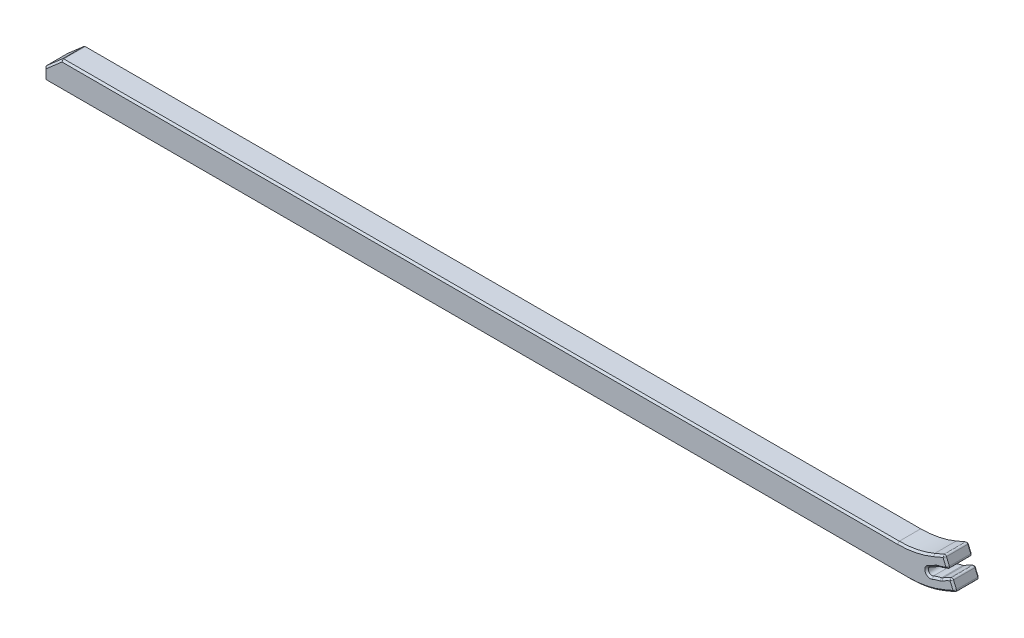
ISO-10303-21;
HEADER;
FILE_DESCRIPTION(('STEP AP214'),'2;1');
FILE_NAME('part.step','',(''),(''),'','','');
FILE_SCHEMA(('AUTOMOTIVE_DESIGN { 1 0 10303 214 1 1 1 1 }'));
ENDSEC;
DATA;
#1=APPLICATION_CONTEXT('core data for automotive mechanical design processes');
#2=APPLICATION_PROTOCOL_DEFINITION('international standard','automotive_design',2000,#1);
#3=PRODUCT_CONTEXT('',#1,'mechanical');
#4=PRODUCT('Part','Part','',(#3));
#5=PRODUCT_RELATED_PRODUCT_CATEGORY('part','',(#4));
#6=PRODUCT_DEFINITION_FORMATION('','',#4);
#7=PRODUCT_DEFINITION_CONTEXT('part definition',#1,'design');
#8=PRODUCT_DEFINITION('design','',#6,#7);
#9=PRODUCT_DEFINITION_SHAPE('','',#8);
#10=(LENGTH_UNIT() NAMED_UNIT(*) SI_UNIT(.MILLI.,.METRE.));
#11=(NAMED_UNIT(*) PLANE_ANGLE_UNIT() SI_UNIT($,.RADIAN.));
#12=(NAMED_UNIT(*) SI_UNIT($,.STERADIAN.) SOLID_ANGLE_UNIT());
#13=UNCERTAINTY_MEASURE_WITH_UNIT(LENGTH_MEASURE(1.E-05),#10,'distance_accuracy_value','');
#14=(GEOMETRIC_REPRESENTATION_CONTEXT(3) GLOBAL_UNCERTAINTY_ASSIGNED_CONTEXT((#13)) GLOBAL_UNIT_ASSIGNED_CONTEXT((#10,
#11,#12)) REPRESENTATION_CONTEXT('',''));
#15=CARTESIAN_POINT('',(0.,0.,0.));
#16=DIRECTION('',(0.,0.,1.));
#17=DIRECTION('',(1.,0.,0.));
#18=AXIS2_PLACEMENT_3D('',#15,#16,#17);
#19=CARTESIAN_POINT('',(-59.8217997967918,-1.30000004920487,2.8));
#20=DIRECTION('',(0.,0.,-1.));
#21=DIRECTION('',(-1.,0.,0.));
#22=AXIS2_PLACEMENT_3D('',#19,#20,#21);
#23=CYLINDRICAL_SURFACE('',#22,0.199999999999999);
#24=DIRECTION('',(0.,0.,-1.));
#25=VECTOR('',#24,1.);
#26=CARTESIAN_POINT('',(-60.0217997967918,-1.30000004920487,2.8));
#27=LINE('',#26,#25);
#28=CARTESIAN_POINT('',(-60.0217997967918,-1.30000004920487,2.60000000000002));
#29=VERTEX_POINT('',#28);
#30=CARTESIAN_POINT('',(-60.0217997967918,-1.30000004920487,0.200000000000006));
#31=VERTEX_POINT('',#30);
#32=EDGE_CURVE('E712',#29,#31,#27,.T.);
#33=ORIENTED_EDGE('',*,*,#32,.T.);
#34=CARTESIAN_POINT('',(-59.8217997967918,-1.30000004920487,0.200000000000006));
#35=DIRECTION('',(0.,0.,-1.));
#36=DIRECTION('',(-1.,0.,0.));
#37=AXIS2_PLACEMENT_3D('',#34,#35,#36);
#38=CIRCLE('',#37,0.199999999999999);
#39=CARTESIAN_POINT('',(-59.8217997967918,-1.50000004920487,0.200000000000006));
#40=VERTEX_POINT('',#39);
#41=EDGE_CURVE('E557',#31,#40,#38,.F.);
#42=ORIENTED_EDGE('',*,*,#41,.T.);
#43=DIRECTION('',(0.,0.,-1.));
#44=VECTOR('',#43,1.);
#45=CARTESIAN_POINT('',(-59.8217997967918,-1.50000004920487,2.8));
#46=LINE('',#45,#44);
#47=CARTESIAN_POINT('',(-59.8217997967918,-1.50000004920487,2.60000000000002));
#48=VERTEX_POINT('',#47);
#49=EDGE_CURVE('E362',#48,#40,#46,.T.);
#50=ORIENTED_EDGE('',*,*,#49,.F.);
#51=CARTESIAN_POINT('',(-59.8217997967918,-1.30000004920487,2.60000000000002));
#52=DIRECTION('',(0.,0.,-1.));
#53=DIRECTION('',(-1.,0.,0.));
#54=AXIS2_PLACEMENT_3D('',#51,#52,#53);
#55=CIRCLE('',#54,0.199999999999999);
#56=EDGE_CURVE('E554',#48,#29,#55,.T.);
#57=ORIENTED_EDGE('',*,*,#56,.T.);
#58=EDGE_LOOP('',(#33,#42,#50,#57));
#59=FACE_BOUND('',#58,.T.);
#60=ADVANCED_FACE('F41',(#59),#23,.T.);
#61=CARTESIAN_POINT('',(-59.8217997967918,-1.50000004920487,2.8));
#62=DIRECTION('',(0.,1.,0.));
#63=DIRECTION('',(-1.,0.,0.));
#64=AXIS2_PLACEMENT_3D('',#61,#62,#63);
#65=PLANE('',#64);
#66=ORIENTED_EDGE('',*,*,#49,.T.);
#67=DIRECTION('',(1.,0.,0.));
#68=VECTOR('',#67,1.);
#69=CARTESIAN_POINT('',(36.9477949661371,-1.50000004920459,0.200000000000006));
#70=LINE('',#69,#68);
#71=CARTESIAN_POINT('',(36.9477949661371,-1.50000004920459,0.200000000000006));
#72=VERTEX_POINT('',#71);
#73=EDGE_CURVE('E563',#40,#72,#70,.T.);
#74=ORIENTED_EDGE('',*,*,#73,.T.);
#75=DIRECTION('',(0.,0.,-1.));
#76=VECTOR('',#75,1.);
#77=CARTESIAN_POINT('',(36.9477949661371,-1.50000004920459,2.8));
#78=LINE('',#77,#76);
#79=CARTESIAN_POINT('',(36.9477949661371,-1.50000004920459,2.60000000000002));
#80=VERTEX_POINT('',#79);
#81=EDGE_CURVE('E343',#80,#72,#78,.T.);
#82=ORIENTED_EDGE('',*,*,#81,.F.);
#83=DIRECTION('',(-1.,0.,0.));
#84=VECTOR('',#83,1.);
#85=CARTESIAN_POINT('',(-59.8217997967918,-1.50000004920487,2.60000000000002));
#86=LINE('',#85,#84);
#87=EDGE_CURVE('E560',#80,#48,#86,.T.);
#88=ORIENTED_EDGE('',*,*,#87,.T.);
#89=EDGE_LOOP('',(#66,#74,#82,#88));
#90=FACE_BOUND('',#89,.T.);
#91=ADVANCED_FACE('F1054',(#90),#65,.F.);
#92=CARTESIAN_POINT('',(36.9477949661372,8.69999995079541,2.8));
#93=DIRECTION('',(0.,0.,-1.));
#94=DIRECTION('',(-1.,0.,0.));
#95=AXIS2_PLACEMENT_3D('',#92,#93,#94);
#96=CYLINDRICAL_SURFACE('',#95,10.2);
#97=ORIENTED_EDGE('',*,*,#81,.T.);
#98=CARTESIAN_POINT('',(36.9477949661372,8.69999995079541,0.200000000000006));
#99=DIRECTION('',(0.,0.,-1.));
#100=DIRECTION('',(-1.,0.,0.));
#101=AXIS2_PLACEMENT_3D('',#98,#99,#100);
#102=CIRCLE('',#101,10.2);
#103=CARTESIAN_POINT('',(40.9332524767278,-0.68914955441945,0.200000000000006));
#104=VERTEX_POINT('',#103);
#105=EDGE_CURVE('E341',#72,#104,#102,.F.);
#106=ORIENTED_EDGE('',*,*,#105,.T.);
#107=DIRECTION('',(0.,0.,-1.));
#108=VECTOR('',#107,1.);
#109=CARTESIAN_POINT('',(40.9332524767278,-0.68914955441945,2.8));
#110=LINE('',#109,#108);
#111=CARTESIAN_POINT('',(40.9332524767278,-0.68914955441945,2.60000000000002));
#112=VERTEX_POINT('',#111);
#113=EDGE_CURVE('E322',#112,#104,#110,.T.);
#114=ORIENTED_EDGE('',*,*,#113,.F.);
#115=CARTESIAN_POINT('',(36.9477949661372,8.69999995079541,2.60000000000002));
#116=DIRECTION('',(0.,0.,-1.));
#117=DIRECTION('',(-1.,0.,0.));
#118=AXIS2_PLACEMENT_3D('',#115,#116,#117);
#119=CIRCLE('',#118,10.2);
#120=EDGE_CURVE('E338',#112,#80,#119,.T.);
#121=ORIENTED_EDGE('',*,*,#120,.T.);
#122=EDGE_LOOP('',(#97,#106,#114,#121));
#123=FACE_BOUND('',#122,.T.);
#124=ADVANCED_FACE('F336',(#123),#96,.T.);
#125=CARTESIAN_POINT('',(40.9332524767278,-0.689149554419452,2.8));
#126=DIRECTION('',(-0.390731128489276,0.920504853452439,0.));
#127=DIRECTION('',(-0.920504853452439,-0.390731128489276,0.));
#128=AXIS2_PLACEMENT_3D('',#125,#126,#127);
#129=PLANE('',#128);
#130=ORIENTED_EDGE('',*,*,#113,.T.);
#131=DIRECTION('',(0.920504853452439,0.390731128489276,0.));
#132=VECTOR('',#131,1.);
#133=CARTESIAN_POINT('',(41.9767547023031,-0.24620913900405,0.200000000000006));
#134=LINE('',#133,#132);
#135=CARTESIAN_POINT('',(41.9767547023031,-0.24620913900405,0.200000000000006));
#136=VERTEX_POINT('',#135);
#137=EDGE_CURVE('E330',#104,#136,#134,.T.);
#138=ORIENTED_EDGE('',*,*,#137,.T.);
#139=DIRECTION('',(0.,0.,-1.));
#140=VECTOR('',#139,1.);
#141=CARTESIAN_POINT('',(41.9767547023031,-0.24620913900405,2.8));
#142=LINE('',#141,#140);
#143=CARTESIAN_POINT('',(41.9767547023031,-0.24620913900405,2.60000000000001));
#144=VERTEX_POINT('',#143);
#145=EDGE_CURVE('E324',#144,#136,#142,.T.);
#146=ORIENTED_EDGE('',*,*,#145,.F.);
#147=DIRECTION('',(-0.920504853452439,-0.390731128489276,0.));
#148=VECTOR('',#147,1.);
#149=CARTESIAN_POINT('',(40.9332524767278,-0.689149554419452,2.60000000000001));
#150=LINE('',#149,#148);
#151=EDGE_CURVE('E319',#144,#112,#150,.T.);
#152=ORIENTED_EDGE('',*,*,#151,.T.);
#153=EDGE_LOOP('',(#130,#138,#146,#152));
#154=FACE_BOUND('',#153,.T.);
#155=ADVANCED_FACE('F321',(#154),#129,.F.);
#156=CARTESIAN_POINT('',(41.8986084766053,-0.0621081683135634,2.8));
#157=DIRECTION('',(0.,0.,-1.));
#158=DIRECTION('',(-1.,0.,0.));
#159=AXIS2_PLACEMENT_3D('',#156,#157,#158);
#160=CYLINDRICAL_SURFACE('',#159,0.2);
#161=ORIENTED_EDGE('',*,*,#145,.T.);
#162=CARTESIAN_POINT('',(41.8986084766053,-0.0621081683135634,0.200000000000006));
#163=DIRECTION('',(0.,0.,-1.));
#164=DIRECTION('',(-1.,0.,0.));
#165=AXIS2_PLACEMENT_3D('',#162,#163,#164);
#166=CIRCLE('',#165,0.2);
#167=CARTESIAN_POINT('',(42.0827094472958,0.0160380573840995,0.200000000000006));
#168=VERTEX_POINT('',#167);
#169=EDGE_CURVE('E430',#136,#168,#166,.F.);
#170=ORIENTED_EDGE('',*,*,#169,.T.);
#171=DIRECTION('',(0.,0.,-1.));
#172=VECTOR('',#171,1.);
#173=CARTESIAN_POINT('',(42.0827094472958,0.0160380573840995,2.8));
#174=LINE('',#173,#172);
#175=CARTESIAN_POINT('',(42.0827094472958,0.0160380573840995,2.60000000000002));
#176=VERTEX_POINT('',#175);
#177=EDGE_CURVE('E856',#176,#168,#174,.T.);
#178=ORIENTED_EDGE('',*,*,#177,.F.);
#179=CARTESIAN_POINT('',(41.8986084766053,-0.0621081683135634,2.60000000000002));
#180=DIRECTION('',(0.,0.,-1.));
#181=DIRECTION('',(-1.,0.,0.));
#182=AXIS2_PLACEMENT_3D('',#179,#180,#181);
#183=CIRCLE('',#182,0.2);
#184=EDGE_CURVE('E427',#176,#144,#183,.T.);
#185=ORIENTED_EDGE('',*,*,#184,.T.);
#186=EDGE_LOOP('',(#161,#170,#178,#185));
#187=FACE_BOUND('',#186,.T.);
#188=ADVANCED_FACE('F879',(#187),#160,.T.);
#189=CARTESIAN_POINT('',(41.756568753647,0.784377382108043,2.8));
#190=DIRECTION('',(-0.92050485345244,-0.390731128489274,0.));
#191=DIRECTION('',(0.390731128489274,-0.92050485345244,0.));
#192=AXIS2_PLACEMENT_3D('',#189,#190,#191);
#193=PLANE('',#192);
#194=ORIENTED_EDGE('',*,*,#177,.T.);
#195=DIRECTION('',(-0.390731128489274,0.92050485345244,0.));
#196=VECTOR('',#195,1.);
#197=CARTESIAN_POINT('',(41.756568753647,0.784377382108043,0.200000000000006));
#198=LINE('',#197,#196);
#199=CARTESIAN_POINT('',(41.756568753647,0.784377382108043,0.200000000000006));
#200=VERTEX_POINT('',#199);
#201=EDGE_CURVE('E436',#168,#200,#198,.T.);
#202=ORIENTED_EDGE('',*,*,#201,.T.);
#203=DIRECTION('',(0.,0.,-1.));
#204=VECTOR('',#203,1.);
#205=CARTESIAN_POINT('',(41.756568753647,0.784377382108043,2.8));
#206=LINE('',#205,#204);
#207=CARTESIAN_POINT('',(41.756568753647,0.784377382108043,2.60000000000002));
#208=VERTEX_POINT('',#207);
#209=EDGE_CURVE('E852',#208,#200,#206,.T.);
#210=ORIENTED_EDGE('',*,*,#209,.F.);
#211=DIRECTION('',(0.390731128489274,-0.92050485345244,0.));
#212=VECTOR('',#211,1.);
#213=CARTESIAN_POINT('',(41.756568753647,0.784377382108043,2.60000000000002));
#214=LINE('',#213,#212);
#215=EDGE_CURVE('E433',#208,#176,#214,.T.);
#216=ORIENTED_EDGE('',*,*,#215,.T.);
#217=EDGE_LOOP('',(#194,#202,#210,#216));
#218=FACE_BOUND('',#217,.T.);
#219=ADVANCED_FACE('F892',(#218),#193,.F.);
#220=CARTESIAN_POINT('',(41.5724677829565,0.706231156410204,2.8));
#221=DIRECTION('',(0.,0.,-1.));
#222=DIRECTION('',(-1.,0.,0.));
#223=AXIS2_PLACEMENT_3D('',#220,#221,#222);
#224=CYLINDRICAL_SURFACE('',#223,0.19999999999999);
#225=ORIENTED_EDGE('',*,*,#209,.T.);
#226=CARTESIAN_POINT('',(41.5724677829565,0.706231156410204,0.200000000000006));
#227=DIRECTION('',(0.,0.,-1.));
#228=DIRECTION('',(-1.,0.,0.));
#229=AXIS2_PLACEMENT_3D('',#226,#227,#228);
#230=CIRCLE('',#229,0.19999999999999);
#231=CARTESIAN_POINT('',(41.4943215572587,0.890332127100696,0.200000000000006));
#232=VERTEX_POINT('',#231);
#233=EDGE_CURVE('E442',#200,#232,#230,.F.);
#234=ORIENTED_EDGE('',*,*,#233,.T.);
#235=DIRECTION('',(0.,0.,-1.));
#236=VECTOR('',#235,1.);
#237=CARTESIAN_POINT('',(41.4943215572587,0.890332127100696,2.8));
#238=LINE('',#237,#236);
#239=CARTESIAN_POINT('',(41.4943215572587,0.890332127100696,2.60000000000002));
#240=VERTEX_POINT('',#239);
#241=EDGE_CURVE('E843',#240,#232,#238,.T.);
#242=ORIENTED_EDGE('',*,*,#241,.F.);
#243=CARTESIAN_POINT('',(41.5724677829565,0.706231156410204,2.60000000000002));
#244=DIRECTION('',(0.,0.,-1.));
#245=DIRECTION('',(-1.,0.,0.));
#246=AXIS2_PLACEMENT_3D('',#243,#244,#245);
#247=CIRCLE('',#246,0.19999999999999);
#248=EDGE_CURVE('E439',#240,#208,#247,.T.);
#249=ORIENTED_EDGE('',*,*,#248,.T.);
#250=EDGE_LOOP('',(#225,#234,#242,#249));
#251=FACE_BOUND('',#250,.T.);
#252=ADVANCED_FACE('F896',(#251),#224,.T.);
#253=CARTESIAN_POINT('',(41.4943215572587,0.890332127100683,2.8));
#254=DIRECTION('',(0.390731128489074,-0.920504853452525,0.));
#255=DIRECTION('',(0.920504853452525,0.390731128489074,0.));
#256=AXIS2_PLACEMENT_3D('',#253,#254,#255);
#257=PLANE('',#256);
#258=ORIENTED_EDGE('',*,*,#241,.T.);
#259=DIRECTION('',(-0.920504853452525,-0.390731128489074,0.));
#260=VECTOR('',#259,1.);
#261=CARTESIAN_POINT('',(41.4179995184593,0.857935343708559,0.200000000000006));
#262=LINE('',#261,#260);
#263=CARTESIAN_POINT('',(41.4179995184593,0.857935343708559,0.200000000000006));
#264=VERTEX_POINT('',#263);
#265=EDGE_CURVE('E448',#232,#264,#262,.T.);
#266=ORIENTED_EDGE('',*,*,#265,.T.);
#267=DIRECTION('',(0.,0.,-1.));
#268=VECTOR('',#267,1.);
#269=CARTESIAN_POINT('',(41.4179995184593,0.857935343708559,2.8));
#270=LINE('',#269,#268);
#271=CARTESIAN_POINT('',(41.4179995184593,0.857935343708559,2.60000000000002));
#272=VERTEX_POINT('',#271);
#273=EDGE_CURVE('E839',#272,#264,#270,.T.);
#274=ORIENTED_EDGE('',*,*,#273,.F.);
#275=DIRECTION('',(0.920504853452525,0.390731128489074,0.));
#276=VECTOR('',#275,1.);
#277=CARTESIAN_POINT('',(41.4943215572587,0.890332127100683,2.60000000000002));
#278=LINE('',#277,#276);
#279=EDGE_CURVE('E445',#272,#240,#278,.T.);
#280=ORIENTED_EDGE('',*,*,#279,.T.);
#281=EDGE_LOOP('',(#258,#266,#274,#280));
#282=FACE_BOUND('',#281,.T.);
#283=ADVANCED_FACE('F908',(#282),#257,.F.);
#284=CARTESIAN_POINT('',(43.3716551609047,-3.74458892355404,2.8));
#285=DIRECTION('',(0.,0.,-1.));
#286=DIRECTION('',(-1.,0.,0.));
#287=AXIS2_PLACEMENT_3D('',#284,#285,#286);
#288=CYLINDRICAL_SURFACE('',#287,5.);
#289=ORIENTED_EDGE('',*,*,#273,.T.);
#290=CARTESIAN_POINT('',(43.3716551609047,-3.74458892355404,0.200000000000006));
#291=DIRECTION('',(0.,0.,-1.));
#292=DIRECTION('',(-1.,0.,0.));
#293=AXIS2_PLACEMENT_3D('',#290,#291,#292);
#294=CIRCLE('',#293,5.);
#295=CARTESIAN_POINT('',(40.5784010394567,0.402425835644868,0.200000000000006));
#296=VERTEX_POINT('',#295);
#297=EDGE_CURVE('E454',#264,#296,#294,.F.);
#298=ORIENTED_EDGE('',*,*,#297,.T.);
#299=DIRECTION('',(0.,0.,-1.));
#300=VECTOR('',#299,1.);
#301=CARTESIAN_POINT('',(40.5784010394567,0.402425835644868,2.8));
#302=LINE('',#301,#300);
#303=CARTESIAN_POINT('',(40.5784010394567,0.402425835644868,2.60000000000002));
#304=VERTEX_POINT('',#303);
#305=EDGE_CURVE('E829',#304,#296,#302,.T.);
#306=ORIENTED_EDGE('',*,*,#305,.F.);
#307=CARTESIAN_POINT('',(43.3716551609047,-3.74458892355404,2.60000000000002));
#308=DIRECTION('',(0.,0.,-1.));
#309=DIRECTION('',(-1.,0.,0.));
#310=AXIS2_PLACEMENT_3D('',#307,#308,#309);
#311=CIRCLE('',#310,5.);
#312=EDGE_CURVE('E451',#304,#272,#311,.T.);
#313=ORIENTED_EDGE('',*,*,#312,.T.);
#314=EDGE_LOOP('',(#289,#298,#306,#313));
#315=FACE_BOUND('',#314,.T.);
#316=ADVANCED_FACE('F835',(#315),#288,.T.);
#317=CARTESIAN_POINT('',(40.2990757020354,0.81712720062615,2.8));
#318=DIRECTION('',(0.,0.,-1.));
#319=DIRECTION('',(-1.,0.,0.));
#320=AXIS2_PLACEMENT_3D('',#317,#318,#319);
#321=CYLINDRICAL_SURFACE('',#320,0.499999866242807);
#322=ORIENTED_EDGE('',*,*,#305,.T.);
#323=CARTESIAN_POINT('',(40.2990757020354,0.81712720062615,0.200000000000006));
#324=DIRECTION('',(0.,0.,-1.));
#325=DIRECTION('',(-1.,0.,0.));
#326=AXIS2_PLACEMENT_3D('',#323,#324,#325);
#327=CIRCLE('',#326,0.499999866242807);
#328=CARTESIAN_POINT('',(40.4033512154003,0.328121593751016,0.200000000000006));
#329=VERTEX_POINT('',#328);
#330=EDGE_CURVE('E460',#296,#329,#327,.T.);
#331=ORIENTED_EDGE('',*,*,#330,.T.);
#332=DIRECTION('',(0.,0.,-1.));
#333=VECTOR('',#332,1.);
#334=CARTESIAN_POINT('',(40.4033512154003,0.328121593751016,2.8));
#335=LINE('',#334,#333);
#336=CARTESIAN_POINT('',(40.4033512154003,0.328121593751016,2.60000000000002));
#337=VERTEX_POINT('',#336);
#338=EDGE_CURVE('E832',#337,#329,#335,.T.);
#339=ORIENTED_EDGE('',*,*,#338,.F.);
#340=CARTESIAN_POINT('',(40.2990757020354,0.81712720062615,2.60000000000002));
#341=DIRECTION('',(0.,0.,-1.));
#342=DIRECTION('',(-1.,0.,0.));
#343=AXIS2_PLACEMENT_3D('',#340,#341,#342);
#344=CIRCLE('',#343,0.499999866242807);
#345=EDGE_CURVE('E457',#337,#304,#344,.F.);
#346=ORIENTED_EDGE('',*,*,#345,.T.);
#347=EDGE_LOOP('',(#322,#331,#339,#346));
#348=FACE_BOUND('',#347,.T.);
#349=ADVANCED_FACE('F828',(#348),#321,.F.);
#350=CARTESIAN_POINT('',(41.446106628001,-4.56193578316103,2.8));
#351=DIRECTION('',(0.,0.,-1.));
#352=DIRECTION('',(-1.,0.,0.));
#353=AXIS2_PLACEMENT_3D('',#350,#351,#352);
#354=CYLINDRICAL_SURFACE('',#353,5.);
#355=ORIENTED_EDGE('',*,*,#338,.T.);
#356=CARTESIAN_POINT('',(41.446106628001,-4.56193578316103,0.200000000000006));
#357=DIRECTION('',(0.,0.,-1.));
#358=DIRECTION('',(-1.,0.,0.));
#359=AXIS2_PLACEMENT_3D('',#356,#357,#358);
#360=CIRCLE('',#359,5.);
#361=CARTESIAN_POINT('',(39.4924509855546,0.0405884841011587,0.200000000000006));
#362=VERTEX_POINT('',#361);
#363=EDGE_CURVE('E466',#329,#362,#360,.F.);
#364=ORIENTED_EDGE('',*,*,#363,.T.);
#365=DIRECTION('',(0.,0.,-1.));
#366=VECTOR('',#365,1.);
#367=CARTESIAN_POINT('',(39.4924509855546,0.0405884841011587,2.8));
#368=LINE('',#367,#366);
#369=CARTESIAN_POINT('',(39.4924509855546,0.0405884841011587,2.60000000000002));
#370=VERTEX_POINT('',#369);
#371=EDGE_CURVE('E845',#370,#362,#368,.T.);
#372=ORIENTED_EDGE('',*,*,#371,.F.);
#373=CARTESIAN_POINT('',(41.446106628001,-4.56193578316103,2.60000000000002));
#374=DIRECTION('',(0.,0.,-1.));
#375=DIRECTION('',(-1.,0.,0.));
#376=AXIS2_PLACEMENT_3D('',#373,#374,#375);
#377=CIRCLE('',#376,5.);
#378=EDGE_CURVE('E463',#370,#337,#377,.T.);
#379=ORIENTED_EDGE('',*,*,#378,.T.);
#380=EDGE_LOOP('',(#355,#364,#372,#379));
#381=FACE_BOUND('',#380,.T.);
#382=ADVANCED_FACE('F920',(#381),#354,.T.);
#383=CARTESIAN_POINT('',(39.3363014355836,0.408453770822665,2.8));
#384=DIRECTION('',(0.,0.,-1.));
#385=DIRECTION('',(-1.,0.,0.));
#386=AXIS2_PLACEMENT_3D('',#383,#384,#385);
#387=CYLINDRICAL_SURFACE('',#386,0.399634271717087);
#388=ORIENTED_EDGE('',*,*,#371,.T.);
#389=CARTESIAN_POINT('',(39.3363014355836,0.408453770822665,0.200000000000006));
#390=DIRECTION('',(0.,0.,-1.));
#391=DIRECTION('',(-1.,0.,0.));
#392=AXIS2_PLACEMENT_3D('',#389,#390,#391);
#393=CIRCLE('',#392,0.399634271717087);
#394=CARTESIAN_POINT('',(39.1801518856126,0.776319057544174,0.200000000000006));
#395=VERTEX_POINT('',#394);
#396=EDGE_CURVE('E472',#362,#395,#393,.T.);
#397=ORIENTED_EDGE('',*,*,#396,.T.);
#398=DIRECTION('',(0.,0.,-1.));
#399=VECTOR('',#398,1.);
#400=CARTESIAN_POINT('',(39.1801518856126,0.776319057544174,2.8));
#401=LINE('',#400,#399);
#402=CARTESIAN_POINT('',(39.1801518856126,0.776319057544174,2.60000000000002));
#403=VERTEX_POINT('',#402);
#404=EDGE_CURVE('E936',#403,#395,#401,.T.);
#405=ORIENTED_EDGE('',*,*,#404,.F.);
#406=CARTESIAN_POINT('',(39.3363014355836,0.408453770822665,2.60000000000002));
#407=DIRECTION('',(0.,0.,-1.));
#408=DIRECTION('',(-1.,0.,0.));
#409=AXIS2_PLACEMENT_3D('',#406,#407,#408);
#410=CIRCLE('',#409,0.399634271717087);
#411=EDGE_CURVE('E469',#403,#370,#410,.F.);
#412=ORIENTED_EDGE('',*,*,#411,.T.);
#413=EDGE_LOOP('',(#388,#397,#405,#412));
#414=FACE_BOUND('',#413,.T.);
#415=ADVANCED_FACE('F935',(#414),#387,.F.);
#416=CARTESIAN_POINT('',(37.2264962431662,5.37884332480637,2.8));
#417=DIRECTION('',(0.,0.,-1.));
#418=DIRECTION('',(-1.,0.,0.));
#419=AXIS2_PLACEMENT_3D('',#416,#417,#418);
#420=CYLINDRICAL_SURFACE('',#419,5.);
#421=ORIENTED_EDGE('',*,*,#404,.T.);
#422=CARTESIAN_POINT('',(37.2264962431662,5.37884332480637,0.200000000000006));
#423=DIRECTION('',(0.,0.,-1.));
#424=DIRECTION('',(-1.,0.,0.));
#425=AXIS2_PLACEMENT_3D('',#422,#423,#424);
#426=CIRCLE('',#425,5.);
#427=CARTESIAN_POINT('',(40.0197503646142,1.23182856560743,0.200000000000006));
#428=VERTEX_POINT('',#427);
#429=EDGE_CURVE('E478',#395,#428,#426,.F.);
#430=ORIENTED_EDGE('',*,*,#429,.T.);
#431=DIRECTION('',(0.,0.,-1.));
#432=VECTOR('',#431,1.);
#433=CARTESIAN_POINT('',(40.0197503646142,1.23182856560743,2.8));
#434=LINE('',#433,#432);
#435=CARTESIAN_POINT('',(40.0197503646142,1.23182856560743,2.60000000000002));
#436=VERTEX_POINT('',#435);
#437=EDGE_CURVE('E943',#436,#428,#434,.T.);
#438=ORIENTED_EDGE('',*,*,#437,.F.);
#439=CARTESIAN_POINT('',(37.2264962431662,5.37884332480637,2.60000000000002));
#440=DIRECTION('',(0.,0.,-1.));
#441=DIRECTION('',(-1.,0.,0.));
#442=AXIS2_PLACEMENT_3D('',#439,#440,#441);
#443=CIRCLE('',#442,5.);
#444=EDGE_CURVE('E475',#436,#403,#443,.T.);
#445=ORIENTED_EDGE('',*,*,#444,.T.);
#446=EDGE_LOOP('',(#421,#430,#438,#445));
#447=FACE_BOUND('',#446,.T.);
#448=ADVANCED_FACE('F939',(#447),#420,.T.);
#449=CARTESIAN_POINT('',(40.2990757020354,0.81712720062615,2.8));
#450=DIRECTION('',(0.,0.,-1.));
#451=DIRECTION('',(-1.,0.,0.));
#452=AXIS2_PLACEMENT_3D('',#449,#450,#451);
#453=CYLINDRICAL_SURFACE('',#452,0.499999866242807);
#454=ORIENTED_EDGE('',*,*,#437,.T.);
#455=CARTESIAN_POINT('',(40.2990757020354,0.81712720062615,0.200000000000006));
#456=DIRECTION('',(0.,0.,-1.));
#457=DIRECTION('',(-1.,0.,0.));
#458=AXIS2_PLACEMENT_3D('',#455,#456,#457);
#459=CIRCLE('',#458,0.499999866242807);
#460=CARTESIAN_POINT('',(40.1948001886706,1.30613280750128,0.200000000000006));
#461=VERTEX_POINT('',#460);
#462=EDGE_CURVE('E484',#428,#461,#459,.T.);
#463=ORIENTED_EDGE('',*,*,#462,.T.);
#464=DIRECTION('',(0.,0.,-1.));
#465=VECTOR('',#464,1.);
#466=CARTESIAN_POINT('',(40.1948001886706,1.30613280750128,2.8));
#467=LINE('',#466,#465);
#468=CARTESIAN_POINT('',(40.1948001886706,1.30613280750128,2.60000000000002));
#469=VERTEX_POINT('',#468);
#470=EDGE_CURVE('E958',#469,#461,#467,.T.);
#471=ORIENTED_EDGE('',*,*,#470,.F.);
#472=CARTESIAN_POINT('',(40.2990757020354,0.81712720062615,2.60000000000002));
#473=DIRECTION('',(0.,0.,-1.));
#474=DIRECTION('',(-1.,0.,0.));
#475=AXIS2_PLACEMENT_3D('',#472,#473,#474);
#476=CIRCLE('',#475,0.499999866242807);
#477=EDGE_CURVE('E481',#469,#436,#476,.F.);
#478=ORIENTED_EDGE('',*,*,#477,.T.);
#479=EDGE_LOOP('',(#454,#463,#471,#478));
#480=FACE_BOUND('',#479,.T.);
#481=ADVANCED_FACE('F957',(#480),#453,.F.);
#482=CARTESIAN_POINT('',(39.1520447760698,6.19619018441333,2.8));
#483=DIRECTION('',(0.,0.,-1.));
#484=DIRECTION('',(-1.,0.,0.));
#485=AXIS2_PLACEMENT_3D('',#482,#483,#484);
#486=CYLINDRICAL_SURFACE('',#485,5.);
#487=ORIENTED_EDGE('',*,*,#470,.T.);
#488=CARTESIAN_POINT('',(39.1520447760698,6.19619018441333,0.200000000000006));
#489=DIRECTION('',(0.,0.,-1.));
#490=DIRECTION('',(-1.,0.,0.));
#491=AXIS2_PLACEMENT_3D('',#488,#489,#490);
#492=CIRCLE('',#491,5.);
#493=CARTESIAN_POINT('',(41.1849110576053,1.62809926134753,0.200000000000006));
#494=VERTEX_POINT('',#493);
#495=EDGE_CURVE('E490',#461,#494,#492,.F.);
#496=ORIENTED_EDGE('',*,*,#495,.T.);
#497=DIRECTION('',(0.,0.,-1.));
#498=VECTOR('',#497,1.);
#499=CARTESIAN_POINT('',(41.1849110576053,1.62809926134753,2.8));
#500=LINE('',#499,#498);
#501=CARTESIAN_POINT('',(41.1849110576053,1.62809926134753,2.60000000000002));
#502=VERTEX_POINT('',#501);
#503=EDGE_CURVE('E966',#502,#494,#500,.T.);
#504=ORIENTED_EDGE('',*,*,#503,.F.);
#505=CARTESIAN_POINT('',(39.1520447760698,6.19619018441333,2.60000000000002));
#506=DIRECTION('',(0.,0.,-1.));
#507=DIRECTION('',(-1.,0.,0.));
#508=AXIS2_PLACEMENT_3D('',#505,#506,#507);
#509=CIRCLE('',#508,5.);
#510=EDGE_CURVE('E487',#502,#469,#509,.T.);
#511=ORIENTED_EDGE('',*,*,#510,.T.);
#512=EDGE_LOOP('',(#487,#496,#504,#511));
#513=FACE_BOUND('',#512,.T.);
#514=ADVANCED_FACE('F961',(#513),#486,.T.);
#515=CARTESIAN_POINT('',(41.1035964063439,1.81082289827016,2.8));
#516=DIRECTION('',(0.,0.,-1.));
#517=DIRECTION('',(-1.,0.,0.));
#518=AXIS2_PLACEMENT_3D('',#515,#516,#517);
#519=CYLINDRICAL_SURFACE('',#518,0.199999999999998);
#520=ORIENTED_EDGE('',*,*,#503,.T.);
#521=CARTESIAN_POINT('',(41.1035964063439,1.81082289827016,0.200000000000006));
#522=DIRECTION('',(0.,0.,-1.));
#523=DIRECTION('',(-1.,0.,0.));
#524=AXIS2_PLACEMENT_3D('',#521,#522,#523);
#525=CIRCLE('',#524,0.199999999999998);
#526=CARTESIAN_POINT('',(41.2876973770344,1.88896912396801,0.200000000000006));
#527=VERTEX_POINT('',#526);
#528=EDGE_CURVE('E496',#494,#527,#525,.F.);
#529=ORIENTED_EDGE('',*,*,#528,.T.);
#530=DIRECTION('',(0.,0.,-1.));
#531=VECTOR('',#530,1.);
#532=CARTESIAN_POINT('',(41.2876973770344,1.88896912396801,2.8));
#533=LINE('',#532,#531);
#534=CARTESIAN_POINT('',(41.2876973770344,1.88896912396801,2.60000000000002));
#535=VERTEX_POINT('',#534);
#536=EDGE_CURVE('E981',#535,#527,#533,.T.);
#537=ORIENTED_EDGE('',*,*,#536,.F.);
#538=CARTESIAN_POINT('',(41.1035964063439,1.81082289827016,2.60000000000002));
#539=DIRECTION('',(0.,0.,-1.));
#540=DIRECTION('',(-1.,0.,0.));
#541=AXIS2_PLACEMENT_3D('',#538,#539,#540);
#542=CIRCLE('',#541,0.199999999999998);
#543=EDGE_CURVE('E493',#535,#502,#542,.T.);
#544=ORIENTED_EDGE('',*,*,#543,.T.);
#545=EDGE_LOOP('',(#520,#529,#537,#544));
#546=FACE_BOUND('',#545,.T.);
#547=ADVANCED_FACE('F980',(#546),#519,.T.);
#548=CARTESIAN_POINT('',(40.9618365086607,2.65664922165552,2.8));
#549=DIRECTION('',(-0.92050485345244,-0.390731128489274,0.));
#550=DIRECTION('',(0.390731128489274,-0.92050485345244,0.));
#551=AXIS2_PLACEMENT_3D('',#548,#549,#550);
#552=PLANE('',#551);
#553=ORIENTED_EDGE('',*,*,#536,.T.);
#554=DIRECTION('',(-0.390731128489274,0.92050485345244,0.));
#555=VECTOR('',#554,1.);
#556=CARTESIAN_POINT('',(40.9618365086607,2.65664922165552,0.200000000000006));
#557=LINE('',#556,#555);
#558=CARTESIAN_POINT('',(40.9618365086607,2.65664922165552,0.200000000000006));
#559=VERTEX_POINT('',#558);
#560=EDGE_CURVE('E502',#527,#559,#557,.T.);
#561=ORIENTED_EDGE('',*,*,#560,.T.);
#562=DIRECTION('',(0.,0.,-1.));
#563=VECTOR('',#562,1.);
#564=CARTESIAN_POINT('',(40.9618365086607,2.65664922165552,2.8));
#565=LINE('',#564,#563);
#566=CARTESIAN_POINT('',(40.9618365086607,2.65664922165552,2.60000000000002));
#567=VERTEX_POINT('',#566);
#568=EDGE_CURVE('E989',#567,#559,#565,.T.);
#569=ORIENTED_EDGE('',*,*,#568,.F.);
#570=DIRECTION('',(0.390731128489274,-0.92050485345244,0.));
#571=VECTOR('',#570,1.);
#572=CARTESIAN_POINT('',(40.9618365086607,2.65664922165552,2.60000000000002));
#573=LINE('',#572,#571);
#574=EDGE_CURVE('E499',#567,#535,#573,.T.);
#575=ORIENTED_EDGE('',*,*,#574,.T.);
#576=EDGE_LOOP('',(#553,#561,#569,#575));
#577=FACE_BOUND('',#576,.T.);
#578=ADVANCED_FACE('F984',(#577),#552,.F.);
#579=CARTESIAN_POINT('',(40.7777355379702,2.57850299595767,2.8));
#580=DIRECTION('',(0.,0.,-1.));
#581=DIRECTION('',(-1.,0.,0.));
#582=AXIS2_PLACEMENT_3D('',#579,#580,#581);
#583=CYLINDRICAL_SURFACE('',#582,0.200000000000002);
#584=ORIENTED_EDGE('',*,*,#568,.T.);
#585=CARTESIAN_POINT('',(40.7777355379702,2.57850299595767,0.200000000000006));
#586=DIRECTION('',(0.,0.,-1.));
#587=DIRECTION('',(-1.,0.,0.));
#588=AXIS2_PLACEMENT_3D('',#585,#586,#587);
#589=CIRCLE('',#588,0.200000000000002);
#590=CARTESIAN_POINT('',(40.6995893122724,2.76260396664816,0.200000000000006));
#591=VERTEX_POINT('',#590);
#592=EDGE_CURVE('E508',#559,#591,#589,.F.);
#593=ORIENTED_EDGE('',*,*,#592,.T.);
#594=DIRECTION('',(0.,0.,-1.));
#595=VECTOR('',#594,1.);
#596=CARTESIAN_POINT('',(40.6995893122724,2.76260396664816,2.8));
#597=LINE('',#596,#595);
#598=CARTESIAN_POINT('',(40.6995893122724,2.76260396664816,2.60000000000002));
#599=VERTEX_POINT('',#598);
#600=EDGE_CURVE('E994',#599,#591,#597,.T.);
#601=ORIENTED_EDGE('',*,*,#600,.F.);
#602=CARTESIAN_POINT('',(40.7777355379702,2.57850299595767,2.60000000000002));
#603=DIRECTION('',(0.,0.,-1.));
#604=DIRECTION('',(-1.,0.,0.));
#605=AXIS2_PLACEMENT_3D('',#602,#603,#604);
#606=CIRCLE('',#605,0.200000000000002);
#607=EDGE_CURVE('E505',#599,#567,#606,.T.);
#608=ORIENTED_EDGE('',*,*,#607,.T.);
#609=EDGE_LOOP('',(#584,#593,#601,#608));
#610=FACE_BOUND('',#609,.T.);
#611=ADVANCED_FACE('F1583',(#610),#583,.T.);
#612=CARTESIAN_POINT('',(39.6556395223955,2.31947357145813,2.8));
#613=DIRECTION('',(0.390731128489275,-0.92050485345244,0.));
#614=DIRECTION('',(0.92050485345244,0.390731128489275,0.));
#615=AXIS2_PLACEMENT_3D('',#612,#613,#614);
#616=PLANE('',#615);
#617=ORIENTED_EDGE('',*,*,#600,.T.);
#618=DIRECTION('',(-0.92050485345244,-0.390731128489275,0.));
#619=VECTOR('',#618,1.);
#620=CARTESIAN_POINT('',(39.6556395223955,2.31947357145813,0.200000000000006));
#621=LINE('',#620,#619);
#622=CARTESIAN_POINT('',(39.6556395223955,2.31947357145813,0.200000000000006));
#623=VERTEX_POINT('',#622);
#624=EDGE_CURVE('E514',#591,#623,#621,.T.);
#625=ORIENTED_EDGE('',*,*,#624,.T.);
#626=DIRECTION('',(0.,0.,-1.));
#627=VECTOR('',#626,1.);
#628=CARTESIAN_POINT('',(39.6556395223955,2.31947357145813,2.8));
#629=LINE('',#628,#627);
#630=CARTESIAN_POINT('',(39.6556395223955,2.31947357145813,2.60000000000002));
#631=VERTEX_POINT('',#630);
#632=EDGE_CURVE('E1003',#631,#623,#629,.T.);
#633=ORIENTED_EDGE('',*,*,#632,.F.);
#634=DIRECTION('',(0.92050485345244,0.390731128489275,0.));
#635=VECTOR('',#634,1.);
#636=CARTESIAN_POINT('',(39.6556395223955,2.31947357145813,2.60000000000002));
#637=LINE('',#636,#635);
#638=EDGE_CURVE('E511',#631,#599,#637,.T.);
#639=ORIENTED_EDGE('',*,*,#638,.T.);
#640=EDGE_LOOP('',(#617,#625,#633,#639));
#641=FACE_BOUND('',#640,.T.);
#642=ADVANCED_FACE('F1573',(#641),#616,.F.);
#643=CARTESIAN_POINT('',(35.6701820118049,11.708623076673,2.8));
#644=DIRECTION('',(0.,0.,-1.));
#645=DIRECTION('',(-1.,0.,0.));
#646=AXIS2_PLACEMENT_3D('',#643,#644,#645);
#647=CYLINDRICAL_SURFACE('',#646,10.2);
#648=ORIENTED_EDGE('',*,*,#632,.T.);
#649=CARTESIAN_POINT('',(35.6701820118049,11.708623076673,0.200000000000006));
#650=DIRECTION('',(0.,0.,-1.));
#651=DIRECTION('',(-1.,0.,0.));
#652=AXIS2_PLACEMENT_3D('',#649,#650,#651);
#653=CIRCLE('',#652,10.2);
#654=CARTESIAN_POINT('',(35.6711158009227,1.50862311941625,0.200000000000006));
#655=VERTEX_POINT('',#654);
#656=EDGE_CURVE('E520',#623,#655,#653,.T.);
#657=ORIENTED_EDGE('',*,*,#656,.T.);
#658=DIRECTION('',(0.,0.,-1.));
#659=VECTOR('',#658,1.);
#660=CARTESIAN_POINT('',(35.6711158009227,1.50862311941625,2.8));
#661=LINE('',#660,#659);
#662=CARTESIAN_POINT('',(35.6711158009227,1.50862311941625,2.60000000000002));
#663=VERTEX_POINT('',#662);
#664=EDGE_CURVE('E1007',#663,#655,#661,.T.);
#665=ORIENTED_EDGE('',*,*,#664,.F.);
#666=CARTESIAN_POINT('',(35.6701820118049,11.708623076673,2.60000000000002));
#667=DIRECTION('',(0.,0.,-1.));
#668=DIRECTION('',(-1.,0.,0.));
#669=AXIS2_PLACEMENT_3D('',#666,#667,#668);
#670=CIRCLE('',#669,10.2);
#671=EDGE_CURVE('E517',#663,#631,#670,.F.);
#672=ORIENTED_EDGE('',*,*,#671,.T.);
#673=EDGE_LOOP('',(#648,#657,#665,#672));
#674=FACE_BOUND('',#673,.T.);
#675=ADVANCED_FACE('F1563',(#674),#647,.F.);
#676=CARTESIAN_POINT('',(-58.0267004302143,1.50004527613,2.8));
#677=DIRECTION('',(9.15479527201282E-05,-0.999999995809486,0.));
#678=DIRECTION('',(0.999999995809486,9.15479527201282E-05,0.));
#679=AXIS2_PLACEMENT_3D('',#676,#677,#678);
#680=PLANE('',#679);
#681=ORIENTED_EDGE('',*,*,#664,.T.);
#682=DIRECTION('',(-0.999999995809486,-9.15479527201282E-05,0.));
#683=VECTOR('',#682,1.);
#684=CARTESIAN_POINT('',(-58.0267004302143,1.50004527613,0.200000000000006));
#685=LINE('',#684,#683);
#686=CARTESIAN_POINT('',(-58.0267004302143,1.50004527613,0.200000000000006));
#687=VERTEX_POINT('',#686);
#688=EDGE_CURVE('E526',#655,#687,#685,.T.);
#689=ORIENTED_EDGE('',*,*,#688,.T.);
#690=DIRECTION('',(0.,0.,-1.));
#691=VECTOR('',#690,1.);
#692=CARTESIAN_POINT('',(-58.0267004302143,1.50004527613,2.8));
#693=LINE('',#692,#691);
#694=CARTESIAN_POINT('',(-58.0267004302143,1.50004527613,2.60000000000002));
#695=VERTEX_POINT('',#694);
#696=EDGE_CURVE('E1011',#695,#687,#693,.T.);
#697=ORIENTED_EDGE('',*,*,#696,.F.);
#698=DIRECTION('',(0.999999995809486,9.15479527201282E-05,0.));
#699=VECTOR('',#698,1.);
#700=CARTESIAN_POINT('',(-58.0267004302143,1.50004527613,2.60000000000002));
#701=LINE('',#700,#699);
#702=EDGE_CURVE('E523',#695,#663,#701,.T.);
#703=ORIENTED_EDGE('',*,*,#702,.T.);
#704=EDGE_LOOP('',(#681,#689,#697,#703));
#705=FACE_BOUND('',#704,.T.);
#706=ADVANCED_FACE('F1553',(#705),#680,.F.);
#707=CARTESIAN_POINT('',(-58.0266821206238,1.30004527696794,2.8));
#708=DIRECTION('',(0.,0.,-1.));
#709=DIRECTION('',(-1.,0.,0.));
#710=AXIS2_PLACEMENT_3D('',#707,#708,#709);
#711=CYLINDRICAL_SURFACE('',#710,0.200000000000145);
#712=ORIENTED_EDGE('',*,*,#696,.T.);
#713=CARTESIAN_POINT('',(-58.0266821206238,1.30004527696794,0.200000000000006));
#714=DIRECTION('',(0.,0.,-1.));
#715=DIRECTION('',(-1.,0.,0.));
#716=AXIS2_PLACEMENT_3D('',#713,#714,#715);
#717=CIRCLE('',#716,0.200000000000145);
#718=CARTESIAN_POINT('',(-58.1579881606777,1.45090522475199,0.200000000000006));
#719=VERTEX_POINT('',#718);
#720=EDGE_CURVE('E532',#687,#719,#717,.F.);
#721=ORIENTED_EDGE('',*,*,#720,.T.);
#722=DIRECTION('',(0.,0.,-1.));
#723=VECTOR('',#722,1.);
#724=CARTESIAN_POINT('',(-58.1579881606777,1.45090522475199,2.8));
#725=LINE('',#724,#723);
#726=CARTESIAN_POINT('',(-58.1579881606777,1.45090522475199,2.60000000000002));
#727=VERTEX_POINT('',#726);
#728=EDGE_CURVE('E1015',#727,#719,#725,.T.);
#729=ORIENTED_EDGE('',*,*,#728,.F.);
#730=CARTESIAN_POINT('',(-58.0266821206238,1.30004527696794,2.60000000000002));
#731=DIRECTION('',(0.,0.,-1.));
#732=DIRECTION('',(-1.,0.,0.));
#733=AXIS2_PLACEMENT_3D('',#730,#731,#732);
#734=CIRCLE('',#733,0.200000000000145);
#735=EDGE_CURVE('E529',#727,#695,#734,.T.);
#736=ORIENTED_EDGE('',*,*,#735,.T.);
#737=EDGE_LOOP('',(#712,#721,#729,#736));
#738=FACE_BOUND('',#737,.T.);
#739=ADVANCED_FACE('F1543',(#738),#711,.T.);
#740=CARTESIAN_POINT('',(-59.9531058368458,-0.111535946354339,2.8));
#741=DIRECTION('',(0.656530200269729,-0.754299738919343,0.));
#742=DIRECTION('',(0.754299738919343,0.656530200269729,0.));
#743=AXIS2_PLACEMENT_3D('',#740,#741,#742);
#744=PLANE('',#743);
#745=ORIENTED_EDGE('',*,*,#728,.T.);
#746=DIRECTION('',(-0.754299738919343,-0.656530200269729,0.));
#747=VECTOR('',#746,1.);
#748=CARTESIAN_POINT('',(-59.9531058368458,-0.11153594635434,0.200000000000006));
#749=LINE('',#748,#747);
#750=CARTESIAN_POINT('',(-59.9531058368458,-0.111535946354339,0.200000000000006));
#751=VERTEX_POINT('',#750);
#752=EDGE_CURVE('E538',#719,#751,#749,.T.);
#753=ORIENTED_EDGE('',*,*,#752,.T.);
#754=DIRECTION('',(0.,0.,-1.));
#755=VECTOR('',#754,1.);
#756=CARTESIAN_POINT('',(-59.9531058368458,-0.111535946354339,2.8));
#757=LINE('',#756,#755);
#758=CARTESIAN_POINT('',(-59.9531058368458,-0.111535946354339,2.60000000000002));
#759=VERTEX_POINT('',#758);
#760=EDGE_CURVE('E1019',#759,#751,#757,.T.);
#761=ORIENTED_EDGE('',*,*,#760,.F.);
#762=DIRECTION('',(0.754299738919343,0.656530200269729,0.));
#763=VECTOR('',#762,1.);
#764=CARTESIAN_POINT('',(-59.9531058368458,-0.111535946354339,2.60000000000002));
#765=LINE('',#764,#763);
#766=EDGE_CURVE('E535',#759,#727,#765,.T.);
#767=ORIENTED_EDGE('',*,*,#766,.T.);
#768=EDGE_LOOP('',(#745,#753,#761,#767));
#769=FACE_BOUND('',#768,.T.);
#770=ADVANCED_FACE('F1533',(#769),#744,.F.);
#771=CARTESIAN_POINT('',(-59.8217997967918,-0.262395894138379,2.8));
#772=DIRECTION('',(0.,0.,-1.));
#773=DIRECTION('',(-1.,0.,0.));
#774=AXIS2_PLACEMENT_3D('',#771,#772,#773);
#775=CYLINDRICAL_SURFACE('',#774,0.200000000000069);
#776=ORIENTED_EDGE('',*,*,#760,.T.);
#777=CARTESIAN_POINT('',(-59.8217997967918,-0.262395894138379,0.200000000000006));
#778=DIRECTION('',(0.,0.,-1.));
#779=DIRECTION('',(-1.,0.,0.));
#780=AXIS2_PLACEMENT_3D('',#777,#778,#779);
#781=CIRCLE('',#780,0.200000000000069);
#782=CARTESIAN_POINT('',(-60.0217997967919,-0.262395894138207,0.200000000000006));
#783=VERTEX_POINT('',#782);
#784=EDGE_CURVE('E544',#751,#783,#781,.F.);
#785=ORIENTED_EDGE('',*,*,#784,.T.);
#786=DIRECTION('',(0.,0.,-1.));
#787=VECTOR('',#786,1.);
#788=CARTESIAN_POINT('',(-60.0217997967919,-0.262395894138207,2.8));
#789=LINE('',#788,#787);
#790=CARTESIAN_POINT('',(-60.0217997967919,-0.262395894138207,2.60000000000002));
#791=VERTEX_POINT('',#790);
#792=EDGE_CURVE('E1023',#791,#783,#789,.T.);
#793=ORIENTED_EDGE('',*,*,#792,.F.);
#794=CARTESIAN_POINT('',(-59.8217997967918,-0.262395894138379,2.60000000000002));
#795=DIRECTION('',(0.,0.,-1.));
#796=DIRECTION('',(-1.,0.,0.));
#797=AXIS2_PLACEMENT_3D('',#794,#795,#796);
#798=CIRCLE('',#797,0.200000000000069);
#799=EDGE_CURVE('E541',#791,#759,#798,.T.);
#800=ORIENTED_EDGE('',*,*,#799,.T.);
#801=EDGE_LOOP('',(#776,#785,#793,#800));
#802=FACE_BOUND('',#801,.T.);
#803=ADVANCED_FACE('F1524',(#802),#775,.T.);
#804=CARTESIAN_POINT('',(-60.0217997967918,-0.262395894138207,2.8));
#805=DIRECTION('',(1.,0.,0.));
#806=DIRECTION('',(0.,1.,0.));
#807=AXIS2_PLACEMENT_3D('',#804,#805,#806);
#808=PLANE('',#807);
#809=ORIENTED_EDGE('',*,*,#792,.T.);
#810=DIRECTION('',(0.,-1.,0.));
#811=VECTOR('',#810,1.);
#812=CARTESIAN_POINT('',(-60.0217997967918,-1.30000004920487,0.200000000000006));
#813=LINE('',#812,#811);
#814=EDGE_CURVE('E551',#783,#31,#813,.T.);
#815=ORIENTED_EDGE('',*,*,#814,.T.);
#816=ORIENTED_EDGE('',*,*,#32,.F.);
#817=DIRECTION('',(0.,1.,0.));
#818=VECTOR('',#817,1.);
#819=CARTESIAN_POINT('',(-60.0217997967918,-0.262395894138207,2.60000000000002));
#820=LINE('',#819,#818);
#821=EDGE_CURVE('E547',#29,#791,#820,.T.);
#822=ORIENTED_EDGE('',*,*,#821,.T.);
#823=EDGE_LOOP('',(#809,#815,#816,#822));
#824=FACE_BOUND('',#823,.T.);
#825=ADVANCED_FACE('F1515',(#824),#808,.F.);
#826=CARTESIAN_POINT('',(-59.8217997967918,-1.30000004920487,2.8));
#827=DIRECTION('',(0.,0.,-1.));
#828=DIRECTION('',(-1.,0.,0.));
#829=AXIS2_PLACEMENT_3D('',#826,#827,#828);
#830=PLANE('',#829);
#831=DIRECTION('',(-0.754299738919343,-0.656530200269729,0.));
#832=VECTOR('',#831,1.);
#833=CARTESIAN_POINT('',(-60.3356427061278,-0.70963638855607,2.8));
#834=LINE('',#833,#832);
#835=CARTESIAN_POINT('',(-58.0266821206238,1.30004527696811,2.8));
#836=VERTEX_POINT('',#835);
#837=CARTESIAN_POINT('',(-59.8217997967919,-0.262395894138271,2.8));
#838=VERTEX_POINT('',#837);
#839=EDGE_CURVE('E52',#836,#838,#834,.T.);
#840=ORIENTED_EDGE('',*,*,#839,.T.);
#841=DIRECTION('',(0.,-1.,0.));
#842=VECTOR('',#841,1.);
#843=CARTESIAN_POINT('',(-59.8217997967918,-1.30000004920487,2.8));
#844=LINE('',#843,#842);
#845=CARTESIAN_POINT('',(-59.8217997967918,-1.30000004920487,2.8));
#846=VERTEX_POINT('',#845);
#847=EDGE_CURVE('E11',#838,#846,#844,.T.);
#848=ORIENTED_EDGE('',*,*,#847,.T.);
#849=DIRECTION('',(1.,0.,0.));
#850=VECTOR('',#849,1.);
#851=CARTESIAN_POINT('',(-59.8217997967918,-1.30000004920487,2.8));
#852=LINE('',#851,#850);
#853=CARTESIAN_POINT('',(36.9477949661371,-1.30000004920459,2.8));
#854=VERTEX_POINT('',#853);
#855=EDGE_CURVE('E566',#846,#854,#852,.T.);
#856=ORIENTED_EDGE('',*,*,#855,.T.);
#857=CARTESIAN_POINT('',(36.9477949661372,8.69999995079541,2.8));
#858=DIRECTION('',(0.,0.,-1.));
#859=DIRECTION('',(-1.,0.,0.));
#860=AXIS2_PLACEMENT_3D('',#857,#858,#859);
#861=CIRCLE('',#860,10.);
#862=CARTESIAN_POINT('',(40.85510625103,-0.505048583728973,2.8));
#863=VERTEX_POINT('',#862);
#864=EDGE_CURVE('E569',#854,#863,#861,.F.);
#865=ORIENTED_EDGE('',*,*,#864,.T.);
#866=DIRECTION('',(0.920504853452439,0.390731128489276,0.));
#867=VECTOR('',#866,1.);
#868=CARTESIAN_POINT('',(-44.7372946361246,-36.836867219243,2.8));
#869=LINE('',#868,#867);
#870=CARTESIAN_POINT('',(41.8986084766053,-0.0621081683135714,2.8));
#871=VERTEX_POINT('',#870);
#872=EDGE_CURVE('E349',#863,#871,#869,.T.);
#873=ORIENTED_EDGE('',*,*,#872,.T.);
#874=DIRECTION('',(-0.390731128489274,0.92050485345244,0.));
#875=VECTOR('',#874,1.);
#876=CARTESIAN_POINT('',(26.8141033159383,35.4747590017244,2.8));
#877=LINE('',#876,#875);
#878=CARTESIAN_POINT('',(41.5724677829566,0.70623115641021,2.8));
#879=VERTEX_POINT('',#878);
#880=EDGE_CURVE('E574',#871,#879,#877,.T.);
#881=ORIENTED_EDGE('',*,*,#880,.T.);
#882=DIRECTION('',(-0.920504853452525,-0.390731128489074,0.));
#883=VECTOR('',#882,1.);
#884=CARTESIAN_POINT('',(-45.0634353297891,-36.0685278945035,2.8));
#885=LINE('',#884,#883);
#886=CARTESIAN_POINT('',(41.4961457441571,0.673834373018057,2.8));
#887=VERTEX_POINT('',#886);
#888=EDGE_CURVE('E577',#879,#887,#885,.T.);
#889=ORIENTED_EDGE('',*,*,#888,.T.);
#890=CARTESIAN_POINT('',(43.3716551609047,-3.74458892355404,2.8));
#891=DIRECTION('',(0.,0.,-1.));
#892=DIRECTION('',(-1.,0.,0.));
#893=AXIS2_PLACEMENT_3D('',#890,#891,#892);
#894=CIRCLE('',#893,4.80000000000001);
#895=CARTESIAN_POINT('',(40.6901312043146,0.236545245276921,2.8));
#896=VERTEX_POINT('',#895);
#897=EDGE_CURVE('E580',#887,#896,#894,.F.);
#898=ORIENTED_EDGE('',*,*,#897,.T.);
#899=CARTESIAN_POINT('',(40.2990757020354,0.81712720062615,2.8));
#900=DIRECTION('',(0.,0.,-1.));
#901=DIRECTION('',(-1.,0.,0.));
#902=AXIS2_PLACEMENT_3D('',#899,#900,#901);
#903=CIRCLE('',#902,0.699999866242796);
#904=CARTESIAN_POINT('',(40.4450614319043,0.132519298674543,2.8));
#905=VERTEX_POINT('',#904);
#906=EDGE_CURVE('E583',#896,#905,#903,.T.);
#907=ORIENTED_EDGE('',*,*,#906,.T.);
#908=CARTESIAN_POINT('',(41.446106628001,-4.56193578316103,2.8));
#909=DIRECTION('',(0.,0.,-1.));
#910=DIRECTION('',(-1.,0.,0.));
#911=AXIS2_PLACEMENT_3D('',#908,#909,#910);
#912=CIRCLE('',#911,4.80000000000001);
#913=CARTESIAN_POINT('',(39.5705972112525,-0.143512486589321,2.8));
#914=VERTEX_POINT('',#913);
#915=EDGE_CURVE('E586',#905,#914,#912,.F.);
#916=ORIENTED_EDGE('',*,*,#915,.T.);
#917=CARTESIAN_POINT('',(39.3363014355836,0.408453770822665,2.8));
#918=DIRECTION('',(0.,0.,-1.));
#919=DIRECTION('',(-1.,0.,0.));
#920=AXIS2_PLACEMENT_3D('',#917,#918,#919);
#921=CIRCLE('',#920,0.599634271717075);
#922=CARTESIAN_POINT('',(39.1020056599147,0.960420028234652,2.8));
#923=VERTEX_POINT('',#922);
#924=EDGE_CURVE('E589',#914,#923,#921,.T.);
#925=ORIENTED_EDGE('',*,*,#924,.T.);
#926=CARTESIAN_POINT('',(37.2264962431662,5.37884332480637,2.8));
#927=DIRECTION('',(0.,0.,-1.));
#928=DIRECTION('',(-1.,0.,0.));
#929=AXIS2_PLACEMENT_3D('',#926,#927,#928);
#930=CIRCLE('',#929,4.80000000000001);
#931=CARTESIAN_POINT('',(39.9080201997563,1.39770915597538,2.8));
#932=VERTEX_POINT('',#931);
#933=EDGE_CURVE('E592',#923,#932,#930,.F.);
#934=ORIENTED_EDGE('',*,*,#933,.T.);
#935=CARTESIAN_POINT('',(40.2990757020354,0.81712720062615,2.8));
#936=DIRECTION('',(0.,0.,-1.));
#937=DIRECTION('',(-1.,0.,0.));
#938=AXIS2_PLACEMENT_3D('',#935,#936,#937);
#939=CIRCLE('',#938,0.699999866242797);
#940=CARTESIAN_POINT('',(40.1530899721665,1.50173510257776,2.8));
#941=VERTEX_POINT('',#940);
#942=EDGE_CURVE('E595',#932,#941,#939,.T.);
#943=ORIENTED_EDGE('',*,*,#942,.T.);
#944=CARTESIAN_POINT('',(39.1520447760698,6.19619018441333,2.8));
#945=DIRECTION('',(0.,0.,-1.));
#946=DIRECTION('',(-1.,0.,0.));
#947=AXIS2_PLACEMENT_3D('',#944,#945,#946);
#948=CIRCLE('',#947,4.80000000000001);
#949=CARTESIAN_POINT('',(41.1035964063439,1.81082289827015,2.8));
#950=VERTEX_POINT('',#949);
#951=EDGE_CURVE('E598',#941,#950,#948,.F.);
#952=ORIENTED_EDGE('',*,*,#951,.T.);
#953=DIRECTION('',(-0.390731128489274,0.92050485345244,0.));
#954=VECTOR('',#953,1.);
#955=CARTESIAN_POINT('',(26.8141033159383,35.4747590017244,2.8));
#956=LINE('',#955,#954);
#957=CARTESIAN_POINT('',(40.7777355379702,2.57850299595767,2.8));
#958=VERTEX_POINT('',#957);
#959=EDGE_CURVE('E601',#950,#958,#956,.T.);
#960=ORIENTED_EDGE('',*,*,#959,.T.);
#961=DIRECTION('',(-0.92050485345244,-0.390731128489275,0.));
#962=VECTOR('',#961,1.);
#963=CARTESIAN_POINT('',(-45.8581675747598,-34.1962560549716,2.8));
#964=LINE('',#963,#962);
#965=CARTESIAN_POINT('',(39.7337857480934,2.13537260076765,2.8));
#966=VERTEX_POINT('',#965);
#967=EDGE_CURVE('E604',#958,#966,#964,.T.);
#968=ORIENTED_EDGE('',*,*,#967,.T.);
#969=CARTESIAN_POINT('',(35.6701820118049,11.708623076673,2.8));
#970=DIRECTION('',(0.,0.,-1.));
#971=DIRECTION('',(-1.,0.,0.));
#972=AXIS2_PLACEMENT_3D('',#969,#970,#971);
#973=CIRCLE('',#972,10.4);
#974=CARTESIAN_POINT('',(35.6711341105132,1.30862312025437,2.8));
#975=VERTEX_POINT('',#974);
#976=EDGE_CURVE('E607',#966,#975,#973,.T.);
#977=ORIENTED_EDGE('',*,*,#976,.T.);
#978=DIRECTION('',(-0.999999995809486,-9.15479527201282E-05,0.));
#979=VECTOR('',#978,1.);
#980=CARTESIAN_POINT('',(-59.8220378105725,1.29988091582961,2.8));
#981=LINE('',#980,#979);
#982=EDGE_CURVE('E63',#975,#836,#981,.T.);
#983=ORIENTED_EDGE('',*,*,#982,.T.);
#984=EDGE_LOOP('',(#840,#848,#856,#865,#873,#881,#889,#898,#907,#916,#925,#934,#943,#952,#960,
#968,#977,#983));
#985=FACE_BOUND('',#984,.T.);
#986=ADVANCED_FACE('F811',(#985),#830,.F.);
#987=CARTESIAN_POINT('',(-59.8217997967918,-1.30000004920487,0.));
#988=DIRECTION('',(0.,0.,-1.));
#989=DIRECTION('',(-1.,0.,0.));
#990=AXIS2_PLACEMENT_3D('',#987,#988,#989);
#991=PLANE('',#990);
#992=DIRECTION('',(-0.920504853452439,-0.390731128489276,0.));
#993=VECTOR('',#992,1.);
#994=CARTESIAN_POINT('',(40.85510625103,-0.505048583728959,0.));
#995=LINE('',#994,#993);
#996=CARTESIAN_POINT('',(41.8986084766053,-0.0621081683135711,0.));
#997=VERTEX_POINT('',#996);
#998=CARTESIAN_POINT('',(40.85510625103,-0.505048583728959,0.));
#999=VERTEX_POINT('',#998);
#1000=EDGE_CURVE('E419',#997,#999,#995,.T.);
#1001=ORIENTED_EDGE('',*,*,#1000,.T.);
#1002=CARTESIAN_POINT('',(36.9477949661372,8.69999995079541,0.));
#1003=DIRECTION('',(0.,0.,-1.));
#1004=DIRECTION('',(-1.,0.,0.));
#1005=AXIS2_PLACEMENT_3D('',#1002,#1003,#1004);
#1006=CIRCLE('',#1005,9.99999999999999);
#1007=CARTESIAN_POINT('',(36.9477949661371,-1.30000004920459,0.));
#1008=VERTEX_POINT('',#1007);
#1009=EDGE_CURVE('E331',#999,#1008,#1006,.T.);
#1010=ORIENTED_EDGE('',*,*,#1009,.T.);
#1011=DIRECTION('',(-1.,0.,0.));
#1012=VECTOR('',#1011,1.);
#1013=CARTESIAN_POINT('',(-59.8217997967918,-1.30000004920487,0.));
#1014=LINE('',#1013,#1012);
#1015=CARTESIAN_POINT('',(-59.8217997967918,-1.30000004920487,0.));
#1016=VERTEX_POINT('',#1015);
#1017=EDGE_CURVE('E366',#1008,#1016,#1014,.T.);
#1018=ORIENTED_EDGE('',*,*,#1017,.T.);
#1019=DIRECTION('',(0.,1.,0.));
#1020=VECTOR('',#1019,1.);
#1021=CARTESIAN_POINT('',(-59.8217997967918,-0.262395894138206,0.));
#1022=LINE('',#1021,#1020);
#1023=CARTESIAN_POINT('',(-59.8217997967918,-0.262395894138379,0.));
#1024=VERTEX_POINT('',#1023);
#1025=EDGE_CURVE('E374',#1016,#1024,#1022,.T.);
#1026=ORIENTED_EDGE('',*,*,#1025,.T.);
#1027=DIRECTION('',(0.754299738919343,0.656530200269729,0.));
#1028=VECTOR('',#1027,1.);
#1029=CARTESIAN_POINT('',(-58.0266821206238,1.3000452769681,0.));
#1030=LINE('',#1029,#1028);
#1031=CARTESIAN_POINT('',(-58.0266821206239,1.30004527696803,0.));
#1032=VERTEX_POINT('',#1031);
#1033=EDGE_CURVE('E377',#1024,#1032,#1030,.T.);
#1034=ORIENTED_EDGE('',*,*,#1033,.T.);
#1035=DIRECTION('',(0.999999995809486,9.15479527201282E-05,0.));
#1036=VECTOR('',#1035,1.);
#1037=CARTESIAN_POINT('',(35.6711341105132,1.30862312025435,0.));
#1038=LINE('',#1037,#1036);
#1039=CARTESIAN_POINT('',(35.6711341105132,1.30862312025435,0.));
#1040=VERTEX_POINT('',#1039);
#1041=EDGE_CURVE('E380',#1032,#1040,#1038,.T.);
#1042=ORIENTED_EDGE('',*,*,#1041,.T.);
#1043=CARTESIAN_POINT('',(35.6701820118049,11.708623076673,0.));
#1044=DIRECTION('',(0.,0.,-1.));
#1045=DIRECTION('',(-1.,0.,0.));
#1046=AXIS2_PLACEMENT_3D('',#1043,#1044,#1045);
#1047=CIRCLE('',#1046,10.4);
#1048=CARTESIAN_POINT('',(39.7337857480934,2.13537260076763,0.));
#1049=VERTEX_POINT('',#1048);
#1050=EDGE_CURVE('E383',#1040,#1049,#1047,.F.);
#1051=ORIENTED_EDGE('',*,*,#1050,.T.);
#1052=DIRECTION('',(0.92050485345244,0.390731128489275,0.));
#1053=VECTOR('',#1052,1.);
#1054=CARTESIAN_POINT('',(40.7777355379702,2.57850299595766,0.));
#1055=LINE('',#1054,#1053);
#1056=CARTESIAN_POINT('',(40.7777355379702,2.57850299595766,0.));
#1057=VERTEX_POINT('',#1056);
#1058=EDGE_CURVE('E386',#1049,#1057,#1055,.T.);
#1059=ORIENTED_EDGE('',*,*,#1058,.T.);
#1060=DIRECTION('',(0.390731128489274,-0.92050485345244,0.));
#1061=VECTOR('',#1060,1.);
#1062=CARTESIAN_POINT('',(41.1035964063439,1.81082289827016,0.));
#1063=LINE('',#1062,#1061);
#1064=CARTESIAN_POINT('',(41.1035964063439,1.81082289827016,0.));
#1065=VERTEX_POINT('',#1064);
#1066=EDGE_CURVE('E389',#1057,#1065,#1063,.T.);
#1067=ORIENTED_EDGE('',*,*,#1066,.T.);
#1068=CARTESIAN_POINT('',(39.1520447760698,6.19619018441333,0.));
#1069=DIRECTION('',(0.,0.,-1.));
#1070=DIRECTION('',(-1.,0.,0.));
#1071=AXIS2_PLACEMENT_3D('',#1068,#1069,#1070);
#1072=CIRCLE('',#1071,4.8);
#1073=CARTESIAN_POINT('',(40.1530899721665,1.50173510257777,0.));
#1074=VERTEX_POINT('',#1073);
#1075=EDGE_CURVE('E392',#1065,#1074,#1072,.T.);
#1076=ORIENTED_EDGE('',*,*,#1075,.T.);
#1077=CARTESIAN_POINT('',(40.2990757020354,0.81712720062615,0.));
#1078=DIRECTION('',(0.,0.,-1.));
#1079=DIRECTION('',(-1.,0.,0.));
#1080=AXIS2_PLACEMENT_3D('',#1077,#1078,#1079);
#1081=CIRCLE('',#1080,0.699999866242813);
#1082=CARTESIAN_POINT('',(39.9080201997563,1.39770915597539,0.));
#1083=VERTEX_POINT('',#1082);
#1084=EDGE_CURVE('E395',#1074,#1083,#1081,.F.);
#1085=ORIENTED_EDGE('',*,*,#1084,.T.);
#1086=CARTESIAN_POINT('',(37.2264962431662,5.37884332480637,0.));
#1087=DIRECTION('',(0.,0.,-1.));
#1088=DIRECTION('',(-1.,0.,0.));
#1089=AXIS2_PLACEMENT_3D('',#1086,#1087,#1088);
#1090=CIRCLE('',#1089,4.79999999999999);
#1091=CARTESIAN_POINT('',(39.1020056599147,0.960420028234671,0.));
#1092=VERTEX_POINT('',#1091);
#1093=EDGE_CURVE('E398',#1083,#1092,#1090,.T.);
#1094=ORIENTED_EDGE('',*,*,#1093,.T.);
#1095=CARTESIAN_POINT('',(39.3363014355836,0.408453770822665,0.));
#1096=DIRECTION('',(0.,0.,-1.));
#1097=DIRECTION('',(-1.,0.,0.));
#1098=AXIS2_PLACEMENT_3D('',#1095,#1096,#1097);
#1099=CIRCLE('',#1098,0.599634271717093);
#1100=CARTESIAN_POINT('',(39.5705972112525,-0.143512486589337,0.));
#1101=VERTEX_POINT('',#1100);
#1102=EDGE_CURVE('E401',#1092,#1101,#1099,.F.);
#1103=ORIENTED_EDGE('',*,*,#1102,.T.);
#1104=CARTESIAN_POINT('',(41.446106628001,-4.56193578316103,0.));
#1105=DIRECTION('',(0.,0.,-1.));
#1106=DIRECTION('',(-1.,0.,0.));
#1107=AXIS2_PLACEMENT_3D('',#1104,#1105,#1106);
#1108=CIRCLE('',#1107,4.79999999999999);
#1109=CARTESIAN_POINT('',(40.4450614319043,0.132519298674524,0.));
#1110=VERTEX_POINT('',#1109);
#1111=EDGE_CURVE('E404',#1101,#1110,#1108,.T.);
#1112=ORIENTED_EDGE('',*,*,#1111,.T.);
#1113=CARTESIAN_POINT('',(40.2990757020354,0.81712720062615,0.));
#1114=DIRECTION('',(0.,0.,-1.));
#1115=DIRECTION('',(-1.,0.,0.));
#1116=AXIS2_PLACEMENT_3D('',#1113,#1114,#1115);
#1117=CIRCLE('',#1116,0.699999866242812);
#1118=CARTESIAN_POINT('',(40.6901312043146,0.236545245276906,0.));
#1119=VERTEX_POINT('',#1118);
#1120=EDGE_CURVE('E407',#1110,#1119,#1117,.F.);
#1121=ORIENTED_EDGE('',*,*,#1120,.T.);
#1122=CARTESIAN_POINT('',(43.3716551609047,-3.74458892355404,0.));
#1123=DIRECTION('',(0.,0.,-1.));
#1124=DIRECTION('',(-1.,0.,0.));
#1125=AXIS2_PLACEMENT_3D('',#1122,#1123,#1124);
#1126=CIRCLE('',#1125,4.79999999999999);
#1127=CARTESIAN_POINT('',(41.4961457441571,0.67383437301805,0.));
#1128=VERTEX_POINT('',#1127);
#1129=EDGE_CURVE('E410',#1119,#1128,#1126,.T.);
#1130=ORIENTED_EDGE('',*,*,#1129,.T.);
#1131=DIRECTION('',(0.920504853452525,0.390731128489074,0.));
#1132=VECTOR('',#1131,1.);
#1133=CARTESIAN_POINT('',(41.5724677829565,0.706231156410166,0.));
#1134=LINE('',#1133,#1132);
#1135=CARTESIAN_POINT('',(41.5724677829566,0.706231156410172,0.));
#1136=VERTEX_POINT('',#1135);
#1137=EDGE_CURVE('E413',#1128,#1136,#1134,.T.);
#1138=ORIENTED_EDGE('',*,*,#1137,.T.);
#1139=DIRECTION('',(0.390731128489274,-0.92050485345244,0.));
#1140=VECTOR('',#1139,1.);
#1141=CARTESIAN_POINT('',(41.8986084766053,-0.0621081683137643,0.));
#1142=LINE('',#1141,#1140);
#1143=EDGE_CURVE('E416',#1136,#997,#1142,.T.);
#1144=ORIENTED_EDGE('',*,*,#1143,.T.);
#1145=EDGE_LOOP('',(#1001,#1010,#1018,#1026,#1034,#1042,#1051,#1059,#1067,#1076,#1085,#1094,
#1103,#1112,#1121,#1130,#1138,#1144));
#1146=FACE_BOUND('',#1145,.T.);
#1147=ADVANCED_FACE('F1170',(#1146),#991,.T.);
#1148=CARTESIAN_POINT('',(41.1035964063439,1.81082289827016,0.200000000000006));
#1149=DIRECTION('',(0.,0.,1.));
#1150=DIRECTION('',(1.,0.,0.));
#1151=AXIS2_PLACEMENT_3D('',#1148,#1149,#1150);
#1152=CONICAL_SURFACE('',#1151,0.200000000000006,0.785398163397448);
#1153=DIRECTION('',(-0.650895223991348,-0.276288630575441,-0.707106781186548));
#1154=VECTOR('',#1153,1.);
#1155=CARTESIAN_POINT('',(41.2876973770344,1.88896912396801,0.200000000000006));
#1156=LINE('',#1155,#1154);
#1157=EDGE_CURVE('E704',#527,#1065,#1156,.T.);
#1158=ORIENTED_EDGE('',*,*,#1157,.F.);
#1159=ORIENTED_EDGE('',*,*,#528,.F.);
#1160=DIRECTION('',(0.287490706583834,-0.646025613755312,0.707106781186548));
#1161=VECTOR('',#1160,1.);
#1162=CARTESIAN_POINT('',(41.1035964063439,1.81082289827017,0.));
#1163=LINE('',#1162,#1161);
#1164=EDGE_CURVE('E708',#1065,#494,#1163,.T.);
#1165=ORIENTED_EDGE('',*,*,#1164,.F.);
#1166=EDGE_LOOP('',(#1158,#1159,#1165));
#1167=FACE_BOUND('',#1166,.T.);
#1168=ADVANCED_FACE('F975',(#1167),#1152,.T.);
#1169=CARTESIAN_POINT('',(39.1520447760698,6.19619018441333,0.200000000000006));
#1170=DIRECTION('',(0.,0.,1.));
#1171=DIRECTION('',(1.,0.,0.));
#1172=AXIS2_PLACEMENT_3D('',#1169,#1170,#1171);
#1173=CONICAL_SURFACE('',#1172,5.,0.785398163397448);
#1174=ORIENTED_EDGE('',*,*,#1164,.T.);
#1175=ORIENTED_EDGE('',*,*,#495,.F.);
#1176=DIRECTION('',(0.14746788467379,-0.691558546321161,0.707106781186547));
#1177=VECTOR('',#1176,1.);
#1178=CARTESIAN_POINT('',(40.1530899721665,1.50173510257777,0.));
#1179=LINE('',#1178,#1177);
#1180=EDGE_CURVE('E700',#1074,#461,#1179,.T.);
#1181=ORIENTED_EDGE('',*,*,#1180,.F.);
#1182=ORIENTED_EDGE('',*,*,#1075,.F.);
#1183=EDGE_LOOP('',(#1174,#1175,#1181,#1182));
#1184=FACE_BOUND('',#1183,.T.);
#1185=ADVANCED_FACE('F969',(#1184),#1173,.T.);
#1186=CARTESIAN_POINT('',(40.9618365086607,2.65664922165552,0.200000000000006));
#1187=DIRECTION('',(0.650895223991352,0.276288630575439,-0.707106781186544));
#1188=DIRECTION('',(0.390731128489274,-0.92050485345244,0.));
#1189=AXIS2_PLACEMENT_3D('',#1186,#1187,#1188);
#1190=PLANE('',#1189);
#1191=ORIENTED_EDGE('',*,*,#1157,.T.);
#1192=ORIENTED_EDGE('',*,*,#1066,.F.);
#1193=DIRECTION('',(-0.650895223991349,-0.276288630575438,-0.707106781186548));
#1194=VECTOR('',#1193,1.);
#1195=CARTESIAN_POINT('',(40.9618365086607,2.65664922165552,0.200000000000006));
#1196=LINE('',#1195,#1194);
#1197=EDGE_CURVE('E696',#559,#1057,#1196,.T.);
#1198=ORIENTED_EDGE('',*,*,#1197,.F.);
#1199=ORIENTED_EDGE('',*,*,#560,.F.);
#1200=EDGE_LOOP('',(#1191,#1192,#1198,#1199));
#1201=FACE_BOUND('',#1200,.T.);
#1202=ADVANCED_FACE('F1160',(#1201),#1190,.T.);
#1203=CARTESIAN_POINT('',(40.2990757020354,0.81712720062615,0.200000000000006));
#1204=DIRECTION('',(0.,0.,-1.));
#1205=DIRECTION('',(-1.,0.,0.));
#1206=AXIS2_PLACEMENT_3D('',#1203,#1204,#1205);
#1207=CONICAL_SURFACE('',#1206,0.499999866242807,0.785398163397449);
#1208=ORIENTED_EDGE('',*,*,#1180,.T.);
#1209=ORIENTED_EDGE('',*,*,#462,.F.);
#1210=DIRECTION('',(0.395025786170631,-0.586476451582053,0.707106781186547));
#1211=VECTOR('',#1210,1.);
#1212=CARTESIAN_POINT('',(39.9080201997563,1.39770915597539,0.));
#1213=LINE('',#1212,#1211);
#1214=EDGE_CURVE('E692',#1083,#428,#1213,.T.);
#1215=ORIENTED_EDGE('',*,*,#1214,.F.);
#1216=ORIENTED_EDGE('',*,*,#1084,.F.);
#1217=EDGE_LOOP('',(#1208,#1209,#1215,#1216));
#1218=FACE_BOUND('',#1217,.T.);
#1219=ADVANCED_FACE('F952',(#1218),#1207,.F.);
#1220=CARTESIAN_POINT('',(40.7777355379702,2.57850299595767,0.200000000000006));
#1221=DIRECTION('',(0.,0.,1.));
#1222=DIRECTION('',(1.,0.,0.));
#1223=AXIS2_PLACEMENT_3D('',#1220,#1221,#1222);
#1224=CONICAL_SURFACE('',#1223,0.200000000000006,0.785398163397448);
#1225=ORIENTED_EDGE('',*,*,#592,.F.);
#1226=ORIENTED_EDGE('',*,*,#1197,.T.);
#1227=DIRECTION('',(0.276288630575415,-0.650895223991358,-0.707106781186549));
#1228=VECTOR('',#1227,1.);
#1229=CARTESIAN_POINT('',(40.6995893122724,2.76260396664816,0.200000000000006));
#1230=LINE('',#1229,#1228);
#1231=EDGE_CURVE('E688',#591,#1057,#1230,.T.);
#1232=ORIENTED_EDGE('',*,*,#1231,.F.);
#1233=EDGE_LOOP('',(#1225,#1226,#1232));
#1234=FACE_BOUND('',#1233,.T.);
#1235=ADVANCED_FACE('F1151',(#1234),#1224,.T.);
#1236=CARTESIAN_POINT('',(37.2264962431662,5.37884332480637,0.200000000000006));
#1237=DIRECTION('',(0.,0.,1.));
#1238=DIRECTION('',(1.,0.,0.));
#1239=AXIS2_PLACEMENT_3D('',#1236,#1237,#1238);
#1240=CONICAL_SURFACE('',#1239,5.,0.78539816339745);
#1241=ORIENTED_EDGE('',*,*,#1214,.T.);
#1242=ORIENTED_EDGE('',*,*,#429,.F.);
#1243=DIRECTION('',(0.276288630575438,-0.650895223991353,0.707106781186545));
#1244=VECTOR('',#1243,1.);
#1245=CARTESIAN_POINT('',(39.1020056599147,0.960420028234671,0.));
#1246=LINE('',#1245,#1244);
#1247=EDGE_CURVE('E684',#1092,#395,#1246,.T.);
#1248=ORIENTED_EDGE('',*,*,#1247,.F.);
#1249=ORIENTED_EDGE('',*,*,#1093,.F.);
#1250=EDGE_LOOP('',(#1241,#1242,#1248,#1249));
#1251=FACE_BOUND('',#1250,.T.);
#1252=ADVANCED_FACE('F946',(#1251),#1240,.T.);
#1253=CARTESIAN_POINT('',(39.6556395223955,2.31947357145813,0.200000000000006));
#1254=DIRECTION('',(-0.276288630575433,0.650895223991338,-0.70710678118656));
#1255=DIRECTION('',(0.92050485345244,0.390731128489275,0.));
#1256=AXIS2_PLACEMENT_3D('',#1253,#1254,#1255);
#1257=PLANE('',#1256);
#1258=ORIENTED_EDGE('',*,*,#1231,.T.);
#1259=ORIENTED_EDGE('',*,*,#1058,.F.);
#1260=DIRECTION('',(0.276288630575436,-0.65089522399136,-0.707106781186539));
#1261=VECTOR('',#1260,1.);
#1262=CARTESIAN_POINT('',(39.6556395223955,2.31947357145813,0.200000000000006));
#1263=LINE('',#1262,#1261);
#1264=EDGE_CURVE('E680',#623,#1049,#1263,.T.);
#1265=ORIENTED_EDGE('',*,*,#1264,.F.);
#1266=ORIENTED_EDGE('',*,*,#624,.F.);
#1267=EDGE_LOOP('',(#1258,#1259,#1265,#1266));
#1268=FACE_BOUND('',#1267,.T.);
#1269=ADVANCED_FACE('F1142',(#1268),#1257,.T.);
#1270=CARTESIAN_POINT('',(39.3363014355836,0.408453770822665,0.200000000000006));
#1271=DIRECTION('',(0.,0.,-1.));
#1272=DIRECTION('',(-1.,0.,0.));
#1273=AXIS2_PLACEMENT_3D('',#1270,#1271,#1272);
#1274=CONICAL_SURFACE('',#1273,0.399634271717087,0.785398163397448);
#1275=ORIENTED_EDGE('',*,*,#1247,.T.);
#1276=ORIENTED_EDGE('',*,*,#396,.F.);
#1277=DIRECTION('',(-0.276288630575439,0.65089522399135,0.707106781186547));
#1278=VECTOR('',#1277,1.);
#1279=CARTESIAN_POINT('',(39.5705972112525,-0.143512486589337,0.));
#1280=LINE('',#1279,#1278);
#1281=EDGE_CURVE('E676',#1101,#362,#1280,.T.);
#1282=ORIENTED_EDGE('',*,*,#1281,.F.);
#1283=ORIENTED_EDGE('',*,*,#1102,.F.);
#1284=EDGE_LOOP('',(#1275,#1276,#1282,#1283));
#1285=FACE_BOUND('',#1284,.T.);
#1286=ADVANCED_FACE('F930',(#1285),#1274,.F.);
#1287=CARTESIAN_POINT('',(35.6701820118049,11.708623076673,0.200000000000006));
#1288=DIRECTION('',(0.,0.,-1.));
#1289=DIRECTION('',(-1.,0.,0.));
#1290=AXIS2_PLACEMENT_3D('',#1287,#1288,#1289);
#1291=CONICAL_SURFACE('',#1290,10.2,0.785398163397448);
#1292=ORIENTED_EDGE('',*,*,#1264,.T.);
#1293=ORIENTED_EDGE('',*,*,#1050,.F.);
#1294=DIRECTION('',(6.4734178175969E-05,-0.70710677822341,-0.707106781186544));
#1295=VECTOR('',#1294,1.);
#1296=CARTESIAN_POINT('',(35.6711158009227,1.50862311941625,0.200000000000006));
#1297=LINE('',#1296,#1295);
#1298=EDGE_CURVE('E672',#655,#1040,#1297,.T.);
#1299=ORIENTED_EDGE('',*,*,#1298,.F.);
#1300=ORIENTED_EDGE('',*,*,#656,.F.);
#1301=EDGE_LOOP('',(#1292,#1293,#1299,#1300));
#1302=FACE_BOUND('',#1301,.T.);
#1303=ADVANCED_FACE('F1133',(#1302),#1291,.F.);
#1304=CARTESIAN_POINT('',(41.446106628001,-4.56193578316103,0.200000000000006));
#1305=DIRECTION('',(0.,0.,1.));
#1306=DIRECTION('',(1.,0.,0.));
#1307=AXIS2_PLACEMENT_3D('',#1304,#1305,#1306);
#1308=CONICAL_SURFACE('',#1307,5.,0.785398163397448);
#1309=ORIENTED_EDGE('',*,*,#1281,.T.);
#1310=ORIENTED_EDGE('',*,*,#363,.F.);
#1311=DIRECTION('',(-0.14746788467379,0.691558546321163,0.707106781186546));
#1312=VECTOR('',#1311,1.);
#1313=CARTESIAN_POINT('',(40.4450614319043,0.132519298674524,0.));
#1314=LINE('',#1313,#1312);
#1315=EDGE_CURVE('E668',#1110,#329,#1314,.T.);
#1316=ORIENTED_EDGE('',*,*,#1315,.F.);
#1317=ORIENTED_EDGE('',*,*,#1111,.F.);
#1318=EDGE_LOOP('',(#1309,#1310,#1316,#1317));
#1319=FACE_BOUND('',#1318,.T.);
#1320=ADVANCED_FACE('F924',(#1319),#1308,.T.);
#1321=CARTESIAN_POINT('',(-58.0267004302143,1.50004527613,0.200000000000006));
#1322=DIRECTION('',(-6.4734178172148E-05,0.707106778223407,-0.707106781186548));
#1323=DIRECTION('',(0.999999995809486,9.15479527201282E-05,0.));
#1324=AXIS2_PLACEMENT_3D('',#1321,#1322,#1323);
#1325=PLANE('',#1324);
#1326=ORIENTED_EDGE('',*,*,#1298,.T.);
#1327=ORIENTED_EDGE('',*,*,#1041,.F.);
#1328=DIRECTION('',(6.47341781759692E-05,-0.707106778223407,-0.707106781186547));
#1329=VECTOR('',#1328,1.);
#1330=CARTESIAN_POINT('',(-58.0267004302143,1.50004527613,0.200000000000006));
#1331=LINE('',#1330,#1329);
#1332=EDGE_CURVE('E664',#687,#1032,#1331,.T.);
#1333=ORIENTED_EDGE('',*,*,#1332,.F.);
#1334=ORIENTED_EDGE('',*,*,#688,.F.);
#1335=EDGE_LOOP('',(#1326,#1327,#1333,#1334));
#1336=FACE_BOUND('',#1335,.T.);
#1337=ADVANCED_FACE('F1124',(#1336),#1325,.T.);
#1338=CARTESIAN_POINT('',(40.2990757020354,0.81712720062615,0.200000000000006));
#1339=DIRECTION('',(0.,0.,-1.));
#1340=DIRECTION('',(-1.,0.,0.));
#1341=AXIS2_PLACEMENT_3D('',#1338,#1339,#1340);
#1342=CONICAL_SURFACE('',#1341,0.499999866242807,0.785398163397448);
#1343=ORIENTED_EDGE('',*,*,#1315,.T.);
#1344=ORIENTED_EDGE('',*,*,#330,.F.);
#1345=DIRECTION('',(-0.395025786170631,0.586476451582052,0.707106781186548));
#1346=VECTOR('',#1345,1.);
#1347=CARTESIAN_POINT('',(40.6901312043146,0.236545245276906,0.));
#1348=LINE('',#1347,#1346);
#1349=EDGE_CURVE('E660',#1119,#296,#1348,.T.);
#1350=ORIENTED_EDGE('',*,*,#1349,.F.);
#1351=ORIENTED_EDGE('',*,*,#1120,.F.);
#1352=EDGE_LOOP('',(#1343,#1344,#1350,#1351));
#1353=FACE_BOUND('',#1352,.T.);
#1354=ADVANCED_FACE('F916',(#1353),#1342,.F.);
#1355=CARTESIAN_POINT('',(-58.0266821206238,1.30004527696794,0.200000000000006));
#1356=DIRECTION('',(0.,0.,1.));
#1357=DIRECTION('',(1.,0.,0.));
#1358=AXIS2_PLACEMENT_3D('',#1355,#1356,#1357);
#1359=CONICAL_SURFACE('',#1358,0.200000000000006,0.785398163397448);
#1360=ORIENTED_EDGE('',*,*,#720,.F.);
#1361=ORIENTED_EDGE('',*,*,#1332,.T.);
#1362=DIRECTION('',(0.464236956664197,-0.533370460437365,-0.707106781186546));
#1363=VECTOR('',#1362,1.);
#1364=CARTESIAN_POINT('',(-58.1579881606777,1.45090522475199,0.200000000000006));
#1365=LINE('',#1364,#1363);
#1366=EDGE_CURVE('E656',#719,#1032,#1365,.T.);
#1367=ORIENTED_EDGE('',*,*,#1366,.F.);
#1368=EDGE_LOOP('',(#1360,#1361,#1367));
#1369=FACE_BOUND('',#1368,.T.);
#1370=ADVANCED_FACE('F1115',(#1369),#1359,.T.);
#1371=CARTESIAN_POINT('',(43.3716551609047,-3.74458892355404,0.200000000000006));
#1372=DIRECTION('',(0.,0.,1.));
#1373=DIRECTION('',(1.,0.,0.));
#1374=AXIS2_PLACEMENT_3D('',#1371,#1372,#1373);
#1375=CONICAL_SURFACE('',#1374,5.,0.785398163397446);
#1376=ORIENTED_EDGE('',*,*,#1349,.T.);
#1377=ORIENTED_EDGE('',*,*,#297,.F.);
#1378=DIRECTION('',(-0.276288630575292,0.650895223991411,0.707106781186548));
#1379=VECTOR('',#1378,1.);
#1380=CARTESIAN_POINT('',(41.4961457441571,0.67383437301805,0.));
#1381=LINE('',#1380,#1379);
#1382=EDGE_CURVE('E652',#1128,#264,#1381,.T.);
#1383=ORIENTED_EDGE('',*,*,#1382,.F.);
#1384=ORIENTED_EDGE('',*,*,#1129,.F.);
#1385=EDGE_LOOP('',(#1376,#1377,#1383,#1384));
#1386=FACE_BOUND('',#1385,.T.);
#1387=ADVANCED_FACE('F911',(#1386),#1375,.T.);
#1388=CARTESIAN_POINT('',(-59.9531058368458,-0.111535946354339,0.200000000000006));
#1389=DIRECTION('',(-0.464236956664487,0.533370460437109,-0.707106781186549));
#1390=DIRECTION('',(0.754299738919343,0.656530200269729,0.));
#1391=AXIS2_PLACEMENT_3D('',#1388,#1389,#1390);
#1392=PLANE('',#1391);
#1393=ORIENTED_EDGE('',*,*,#1366,.T.);
#1394=ORIENTED_EDGE('',*,*,#1033,.F.);
#1395=DIRECTION('',(0.464236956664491,-0.533370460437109,-0.707106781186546));
#1396=VECTOR('',#1395,1.);
#1397=CARTESIAN_POINT('',(-59.9531058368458,-0.111535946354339,0.200000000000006));
#1398=LINE('',#1397,#1396);
#1399=EDGE_CURVE('E648',#751,#1024,#1398,.T.);
#1400=ORIENTED_EDGE('',*,*,#1399,.F.);
#1401=ORIENTED_EDGE('',*,*,#752,.F.);
#1402=EDGE_LOOP('',(#1393,#1394,#1400,#1401));
#1403=FACE_BOUND('',#1402,.T.);
#1404=ADVANCED_FACE('F1106',(#1403),#1392,.T.);
#1405=CARTESIAN_POINT('',(41.4943215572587,0.890332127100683,0.200000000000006));
#1406=DIRECTION('',(-0.276288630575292,0.650895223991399,-0.70710678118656));
#1407=DIRECTION('',(0.920504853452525,0.390731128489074,0.));
#1408=AXIS2_PLACEMENT_3D('',#1405,#1406,#1407);
#1409=PLANE('',#1408);
#1410=ORIENTED_EDGE('',*,*,#1382,.T.);
#1411=ORIENTED_EDGE('',*,*,#265,.F.);
#1412=DIRECTION('',(-0.276288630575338,0.650895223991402,0.707106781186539));
#1413=VECTOR('',#1412,1.);
#1414=CARTESIAN_POINT('',(41.5724677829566,0.706231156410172,0.));
#1415=LINE('',#1414,#1413);
#1416=EDGE_CURVE('E644',#1136,#232,#1415,.T.);
#1417=ORIENTED_EDGE('',*,*,#1416,.F.);
#1418=ORIENTED_EDGE('',*,*,#1137,.F.);
#1419=EDGE_LOOP('',(#1410,#1411,#1417,#1418));
#1420=FACE_BOUND('',#1419,.T.);
#1421=ADVANCED_FACE('F905',(#1420),#1409,.T.);
#1422=CARTESIAN_POINT('',(-59.8217997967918,-0.262395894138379,0.200000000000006));
#1423=DIRECTION('',(0.,0.,1.));
#1424=DIRECTION('',(1.,0.,0.));
#1425=AXIS2_PLACEMENT_3D('',#1422,#1423,#1424);
#1426=CONICAL_SURFACE('',#1425,0.200000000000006,0.785398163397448);
#1427=ORIENTED_EDGE('',*,*,#784,.F.);
#1428=ORIENTED_EDGE('',*,*,#1399,.T.);
#1429=DIRECTION('',(0.707106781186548,-6.0795083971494E-13,-0.707106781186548));
#1430=VECTOR('',#1429,1.);
#1431=CARTESIAN_POINT('',(-60.0217997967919,-0.262395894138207,0.200000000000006));
#1432=LINE('',#1431,#1430);
#1433=EDGE_CURVE('E640',#783,#1024,#1432,.T.);
#1434=ORIENTED_EDGE('',*,*,#1433,.F.);
#1435=EDGE_LOOP('',(#1427,#1428,#1434));
#1436=FACE_BOUND('',#1435,.T.);
#1437=ADVANCED_FACE('F1097',(#1436),#1426,.T.);
#1438=CARTESIAN_POINT('',(41.5724677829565,0.706231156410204,0.200000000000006));
#1439=DIRECTION('',(0.,0.,1.));
#1440=DIRECTION('',(1.,0.,0.));
#1441=AXIS2_PLACEMENT_3D('',#1438,#1439,#1440);
#1442=CONICAL_SURFACE('',#1441,0.200000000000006,0.785398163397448);
#1443=ORIENTED_EDGE('',*,*,#1416,.T.);
#1444=ORIENTED_EDGE('',*,*,#233,.F.);
#1445=DIRECTION('',(0.650895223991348,0.27628863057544,0.707106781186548));
#1446=VECTOR('',#1445,1.);
#1447=CARTESIAN_POINT('',(41.5724677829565,0.70623115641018,0.));
#1448=LINE('',#1447,#1446);
#1449=EDGE_CURVE('E636',#1136,#200,#1448,.T.);
#1450=ORIENTED_EDGE('',*,*,#1449,.F.);
#1451=EDGE_LOOP('',(#1443,#1444,#1450));
#1452=FACE_BOUND('',#1451,.T.);
#1453=ADVANCED_FACE('F900',(#1452),#1442,.T.);
#1454=CARTESIAN_POINT('',(-60.0217997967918,-0.262395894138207,0.200000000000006));
#1455=DIRECTION('',(-0.70710678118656,0.,-0.707106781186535));
#1456=DIRECTION('',(0.,1.,0.));
#1457=AXIS2_PLACEMENT_3D('',#1454,#1455,#1456);
#1458=PLANE('',#1457);
#1459=ORIENTED_EDGE('',*,*,#1433,.T.);
#1460=ORIENTED_EDGE('',*,*,#1025,.F.);
#1461=DIRECTION('',(0.707106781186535,0.,-0.70710678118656));
#1462=VECTOR('',#1461,1.);
#1463=CARTESIAN_POINT('',(-60.0217997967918,-1.30000004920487,0.200000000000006));
#1464=LINE('',#1463,#1462);
#1465=EDGE_CURVE('E632',#31,#1016,#1464,.T.);
#1466=ORIENTED_EDGE('',*,*,#1465,.F.);
#1467=ORIENTED_EDGE('',*,*,#814,.F.);
#1468=EDGE_LOOP('',(#1459,#1460,#1466,#1467));
#1469=FACE_BOUND('',#1468,.T.);
#1470=ADVANCED_FACE('F1040',(#1469),#1458,.T.);
#1471=CARTESIAN_POINT('',(41.756568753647,0.784377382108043,0.200000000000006));
#1472=DIRECTION('',(0.650895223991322,0.276288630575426,-0.707106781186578));
#1473=DIRECTION('',(0.390731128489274,-0.92050485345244,0.));
#1474=AXIS2_PLACEMENT_3D('',#1471,#1472,#1473);
#1475=PLANE('',#1474);
#1476=ORIENTED_EDGE('',*,*,#1449,.T.);
#1477=ORIENTED_EDGE('',*,*,#201,.F.);
#1478=DIRECTION('',(0.650895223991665,0.276288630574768,0.707106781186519));
#1479=VECTOR('',#1478,1.);
#1480=CARTESIAN_POINT('',(41.8986084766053,-0.0621081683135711,0.));
#1481=LINE('',#1480,#1479);
#1482=EDGE_CURVE('E628',#997,#168,#1481,.T.);
#1483=ORIENTED_EDGE('',*,*,#1482,.F.);
#1484=ORIENTED_EDGE('',*,*,#1143,.F.);
#1485=EDGE_LOOP('',(#1476,#1477,#1483,#1484));
#1486=FACE_BOUND('',#1485,.T.);
#1487=ADVANCED_FACE('F888',(#1486),#1475,.T.);
#1488=CARTESIAN_POINT('',(-59.8217997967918,-1.30000004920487,0.200000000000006));
#1489=DIRECTION('',(0.,0.,1.));
#1490=DIRECTION('',(1.,0.,0.));
#1491=AXIS2_PLACEMENT_3D('',#1488,#1489,#1490);
#1492=CONICAL_SURFACE('',#1491,0.200000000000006,0.785398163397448);
#1493=ORIENTED_EDGE('',*,*,#41,.F.);
#1494=ORIENTED_EDGE('',*,*,#1465,.T.);
#1495=DIRECTION('',(0.,0.707106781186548,-0.707106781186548));
#1496=VECTOR('',#1495,1.);
#1497=CARTESIAN_POINT('',(-59.8217997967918,-1.50000004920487,0.200000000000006));
#1498=LINE('',#1497,#1496);
#1499=EDGE_CURVE('E624',#40,#1016,#1498,.T.);
#1500=ORIENTED_EDGE('',*,*,#1499,.F.);
#1501=EDGE_LOOP('',(#1493,#1494,#1500));
#1502=FACE_BOUND('',#1501,.T.);
#1503=ADVANCED_FACE('F1043',(#1502),#1492,.T.);
#1504=CARTESIAN_POINT('',(41.8986084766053,-0.0621081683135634,0.200000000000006));
#1505=DIRECTION('',(0.,0.,1.));
#1506=DIRECTION('',(1.,0.,0.));
#1507=AXIS2_PLACEMENT_3D('',#1504,#1505,#1506);
#1508=CONICAL_SURFACE('',#1507,0.200000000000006,0.785398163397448);
#1509=ORIENTED_EDGE('',*,*,#1482,.T.);
#1510=ORIENTED_EDGE('',*,*,#169,.F.);
#1511=DIRECTION('',(0.276288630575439,-0.65089522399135,0.707106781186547));
#1512=VECTOR('',#1511,1.);
#1513=CARTESIAN_POINT('',(41.8986084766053,-0.0621081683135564,0.));
#1514=LINE('',#1513,#1512);
#1515=EDGE_CURVE('E620',#997,#136,#1514,.T.);
#1516=ORIENTED_EDGE('',*,*,#1515,.F.);
#1517=EDGE_LOOP('',(#1509,#1510,#1516));
#1518=FACE_BOUND('',#1517,.T.);
#1519=ADVANCED_FACE('F883',(#1518),#1508,.T.);
#1520=CARTESIAN_POINT('',(-59.8217997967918,-1.50000004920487,0.200000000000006));
#1521=DIRECTION('',(0.,-0.707106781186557,-0.707106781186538));
#1522=DIRECTION('',(-1.,0.,0.));
#1523=AXIS2_PLACEMENT_3D('',#1520,#1521,#1522);
#1524=PLANE('',#1523);
#1525=ORIENTED_EDGE('',*,*,#1499,.T.);
#1526=ORIENTED_EDGE('',*,*,#1017,.F.);
#1527=DIRECTION('',(0.,0.707106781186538,-0.707106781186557));
#1528=VECTOR('',#1527,1.);
#1529=CARTESIAN_POINT('',(36.9477949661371,-1.50000004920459,0.200000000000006));
#1530=LINE('',#1529,#1528);
#1531=EDGE_CURVE('E617',#72,#1008,#1530,.T.);
#1532=ORIENTED_EDGE('',*,*,#1531,.F.);
#1533=ORIENTED_EDGE('',*,*,#73,.F.);
#1534=EDGE_LOOP('',(#1525,#1526,#1532,#1533));
#1535=FACE_BOUND('',#1534,.T.);
#1536=ADVANCED_FACE('F867',(#1535),#1524,.T.);
#1537=CARTESIAN_POINT('',(40.9332524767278,-0.689149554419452,0.200000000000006));
#1538=DIRECTION('',(0.276288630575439,-0.650895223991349,-0.707106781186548));
#1539=DIRECTION('',(-0.920504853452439,-0.390731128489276,0.));
#1540=AXIS2_PLACEMENT_3D('',#1537,#1538,#1539);
#1541=PLANE('',#1540);
#1542=ORIENTED_EDGE('',*,*,#1515,.T.);
#1543=ORIENTED_EDGE('',*,*,#137,.F.);
#1544=DIRECTION('',(0.276288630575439,-0.650895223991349,0.707106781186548));
#1545=VECTOR('',#1544,1.);
#1546=CARTESIAN_POINT('',(40.85510625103,-0.505048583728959,0.));
#1547=LINE('',#1546,#1545);
#1548=EDGE_CURVE('E614',#999,#104,#1547,.T.);
#1549=ORIENTED_EDGE('',*,*,#1548,.F.);
#1550=ORIENTED_EDGE('',*,*,#1000,.F.);
#1551=EDGE_LOOP('',(#1542,#1543,#1549,#1550));
#1552=FACE_BOUND('',#1551,.T.);
#1553=ADVANCED_FACE('F875',(#1552),#1541,.T.);
#1554=CARTESIAN_POINT('',(36.9477949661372,8.69999995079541,0.200000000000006));
#1555=DIRECTION('',(0.,0.,1.));
#1556=DIRECTION('',(1.,0.,0.));
#1557=AXIS2_PLACEMENT_3D('',#1554,#1555,#1556);
#1558=CONICAL_SURFACE('',#1557,10.2,0.785398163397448);
#1559=ORIENTED_EDGE('',*,*,#1531,.T.);
#1560=ORIENTED_EDGE('',*,*,#1009,.F.);
#1561=ORIENTED_EDGE('',*,*,#1548,.T.);
#1562=ORIENTED_EDGE('',*,*,#105,.F.);
#1563=EDGE_LOOP('',(#1559,#1560,#1561,#1562));
#1564=FACE_BOUND('',#1563,.T.);
#1565=ADVANCED_FACE('F870',(#1564),#1558,.T.);
#1566=CARTESIAN_POINT('',(37.2264962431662,5.37884332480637,2.8));
#1567=DIRECTION('',(0.,0.,-1.));
#1568=DIRECTION('',(-1.,0.,0.));
#1569=AXIS2_PLACEMENT_3D('',#1566,#1567,#1568);
#1570=CONICAL_SURFACE('',#1569,4.80000000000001,0.785398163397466);
#1571=DIRECTION('',(0.395025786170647,-0.586476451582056,-0.707106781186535));
#1572=VECTOR('',#1571,1.);
#1573=CARTESIAN_POINT('',(39.9080201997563,1.39770915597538,2.8));
#1574=LINE('',#1573,#1572);
#1575=EDGE_CURVE('E793',#932,#436,#1574,.T.);
#1576=ORIENTED_EDGE('',*,*,#1575,.F.);
#1577=ORIENTED_EDGE('',*,*,#933,.F.);
#1578=DIRECTION('',(-0.276288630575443,0.650895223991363,0.707106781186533));
#1579=VECTOR('',#1578,1.);
#1580=CARTESIAN_POINT('',(39.1801518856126,0.776319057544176,2.60000000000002));
#1581=LINE('',#1580,#1579);
#1582=EDGE_CURVE('E46',#403,#923,#1581,.T.);
#1583=ORIENTED_EDGE('',*,*,#1582,.F.);
#1584=ORIENTED_EDGE('',*,*,#444,.F.);
#1585=EDGE_LOOP('',(#1576,#1577,#1583,#1584));
#1586=FACE_BOUND('',#1585,.T.);
#1587=ADVANCED_FACE('F44',(#1586),#1570,.T.);
#1588=CARTESIAN_POINT('',(39.3363014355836,0.408453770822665,2.8));
#1589=DIRECTION('',(0.,0.,1.));
#1590=DIRECTION('',(1.,0.,0.));
#1591=AXIS2_PLACEMENT_3D('',#1588,#1589,#1590);
#1592=CONICAL_SURFACE('',#1591,0.599634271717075,0.785398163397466);
#1593=ORIENTED_EDGE('',*,*,#1582,.T.);
#1594=ORIENTED_EDGE('',*,*,#924,.F.);
#1595=DIRECTION('',(0.276288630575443,-0.650895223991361,0.707106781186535));
#1596=VECTOR('',#1595,1.);
#1597=CARTESIAN_POINT('',(39.4924509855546,0.0405884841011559,2.60000000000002));
#1598=LINE('',#1597,#1596);
#1599=EDGE_CURVE('E790',#370,#914,#1598,.T.);
#1600=ORIENTED_EDGE('',*,*,#1599,.F.);
#1601=ORIENTED_EDGE('',*,*,#411,.F.);
#1602=EDGE_LOOP('',(#1593,#1594,#1600,#1601));
#1603=FACE_BOUND('',#1602,.T.);
#1604=ADVANCED_FACE('F806',(#1603),#1592,.F.);
#1605=CARTESIAN_POINT('',(40.2990757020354,0.81712720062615,2.8));
#1606=DIRECTION('',(0.,0.,1.));
#1607=DIRECTION('',(1.,0.,0.));
#1608=AXIS2_PLACEMENT_3D('',#1605,#1606,#1607);
#1609=CONICAL_SURFACE('',#1608,0.699999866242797,0.785398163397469);
#1610=ORIENTED_EDGE('',*,*,#1575,.T.);
#1611=ORIENTED_EDGE('',*,*,#477,.F.);
#1612=DIRECTION('',(0.147467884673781,-0.691558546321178,-0.707106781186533));
#1613=VECTOR('',#1612,1.);
#1614=CARTESIAN_POINT('',(40.1530899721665,1.50173510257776,2.8));
#1615=LINE('',#1614,#1613);
#1616=EDGE_CURVE('E786',#941,#469,#1615,.T.);
#1617=ORIENTED_EDGE('',*,*,#1616,.F.);
#1618=ORIENTED_EDGE('',*,*,#942,.F.);
#1619=EDGE_LOOP('',(#1610,#1611,#1617,#1618));
#1620=FACE_BOUND('',#1619,.T.);
#1621=ADVANCED_FACE('F1318',(#1620),#1609,.F.);
#1622=CARTESIAN_POINT('',(41.446106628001,-4.56193578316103,2.8));
#1623=DIRECTION('',(0.,0.,-1.));
#1624=DIRECTION('',(-1.,0.,0.));
#1625=AXIS2_PLACEMENT_3D('',#1622,#1623,#1624);
#1626=CONICAL_SURFACE('',#1625,4.80000000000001,0.785398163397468);
#1627=ORIENTED_EDGE('',*,*,#1599,.T.);
#1628=ORIENTED_EDGE('',*,*,#915,.F.);
#1629=DIRECTION('',(0.147467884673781,-0.691558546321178,0.707106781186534));
#1630=VECTOR('',#1629,1.);
#1631=CARTESIAN_POINT('',(40.4033512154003,0.328121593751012,2.60000000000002));
#1632=LINE('',#1631,#1630);
#1633=EDGE_CURVE('E782',#337,#905,#1632,.T.);
#1634=ORIENTED_EDGE('',*,*,#1633,.F.);
#1635=ORIENTED_EDGE('',*,*,#378,.F.);
#1636=EDGE_LOOP('',(#1627,#1628,#1634,#1635));
#1637=FACE_BOUND('',#1636,.T.);
#1638=ADVANCED_FACE('F817',(#1637),#1626,.T.);
#1639=CARTESIAN_POINT('',(39.1520447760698,6.19619018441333,2.8));
#1640=DIRECTION('',(0.,0.,-1.));
#1641=DIRECTION('',(-1.,0.,0.));
#1642=AXIS2_PLACEMENT_3D('',#1639,#1640,#1641);
#1643=CONICAL_SURFACE('',#1642,4.80000000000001,0.785398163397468);
#1644=ORIENTED_EDGE('',*,*,#1616,.T.);
#1645=ORIENTED_EDGE('',*,*,#510,.F.);
#1646=DIRECTION('',(0.287490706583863,-0.646025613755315,-0.707106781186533));
#1647=VECTOR('',#1646,1.);
#1648=CARTESIAN_POINT('',(41.1035964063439,1.81082289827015,2.8));
#1649=LINE('',#1648,#1647);
#1650=EDGE_CURVE('E778',#950,#502,#1649,.T.);
#1651=ORIENTED_EDGE('',*,*,#1650,.F.);
#1652=ORIENTED_EDGE('',*,*,#951,.F.);
#1653=EDGE_LOOP('',(#1644,#1645,#1651,#1652));
#1654=FACE_BOUND('',#1653,.T.);
#1655=ADVANCED_FACE('F1306',(#1654),#1643,.T.);
#1656=CARTESIAN_POINT('',(40.2990757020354,0.81712720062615,2.8));
#1657=DIRECTION('',(0.,0.,1.));
#1658=DIRECTION('',(1.,0.,0.));
#1659=AXIS2_PLACEMENT_3D('',#1656,#1657,#1658);
#1660=CONICAL_SURFACE('',#1659,0.699999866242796,0.785398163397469);
#1661=ORIENTED_EDGE('',*,*,#1633,.T.);
#1662=ORIENTED_EDGE('',*,*,#906,.F.);
#1663=DIRECTION('',(0.395025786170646,-0.58647645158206,0.707106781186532));
#1664=VECTOR('',#1663,1.);
#1665=CARTESIAN_POINT('',(40.5784010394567,0.402425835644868,2.60000000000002));
#1666=LINE('',#1665,#1664);
#1667=EDGE_CURVE('E774',#304,#896,#1666,.T.);
#1668=ORIENTED_EDGE('',*,*,#1667,.F.);
#1669=ORIENTED_EDGE('',*,*,#345,.F.);
#1670=EDGE_LOOP('',(#1661,#1662,#1668,#1669));
#1671=FACE_BOUND('',#1670,.T.);
#1672=ADVANCED_FACE('F821',(#1671),#1660,.F.);
#1673=CARTESIAN_POINT('',(41.1035964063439,1.81082289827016,2.60000000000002));
#1674=DIRECTION('',(0.,0.,-1.));
#1675=DIRECTION('',(-1.,0.,0.));
#1676=AXIS2_PLACEMENT_3D('',#1673,#1674,#1675);
#1677=CONICAL_SURFACE('',#1676,0.199999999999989,0.785398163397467);
#1678=ORIENTED_EDGE('',*,*,#1650,.T.);
#1679=ORIENTED_EDGE('',*,*,#543,.F.);
#1680=DIRECTION('',(0.650895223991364,0.276288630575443,-0.707106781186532));
#1681=VECTOR('',#1680,1.);
#1682=CARTESIAN_POINT('',(41.1035964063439,1.81082289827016,2.8));
#1683=LINE('',#1682,#1681);
#1684=EDGE_CURVE('E770',#950,#535,#1683,.T.);
#1685=ORIENTED_EDGE('',*,*,#1684,.F.);
#1686=EDGE_LOOP('',(#1678,#1679,#1685));
#1687=FACE_BOUND('',#1686,.T.);
#1688=ADVANCED_FACE('F1293',(#1687),#1677,.T.);
#1689=CARTESIAN_POINT('',(43.3716551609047,-3.74458892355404,2.8));
#1690=DIRECTION('',(0.,0.,-1.));
#1691=DIRECTION('',(-1.,0.,0.));
#1692=AXIS2_PLACEMENT_3D('',#1689,#1690,#1691);
#1693=CONICAL_SURFACE('',#1692,4.80000000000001,0.785398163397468);
#1694=ORIENTED_EDGE('',*,*,#1667,.T.);
#1695=ORIENTED_EDGE('',*,*,#897,.F.);
#1696=DIRECTION('',(0.27628863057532,-0.650895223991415,0.707106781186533));
#1697=VECTOR('',#1696,1.);
#1698=CARTESIAN_POINT('',(41.4179995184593,0.857935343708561,2.60000000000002));
#1699=LINE('',#1698,#1697);
#1700=EDGE_CURVE('E766',#272,#887,#1699,.T.);
#1701=ORIENTED_EDGE('',*,*,#1700,.F.);
#1702=ORIENTED_EDGE('',*,*,#312,.F.);
#1703=EDGE_LOOP('',(#1694,#1695,#1701,#1702));
#1704=FACE_BOUND('',#1703,.T.);
#1705=ADVANCED_FACE('F1286',(#1704),#1693,.T.);
#1706=CARTESIAN_POINT('',(26.8141033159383,35.4747590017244,2.8));
#1707=DIRECTION('',(-0.650895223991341,-0.276288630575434,-0.707106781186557));
#1708=DIRECTION('',(-0.390731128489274,0.92050485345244,0.));
#1709=AXIS2_PLACEMENT_3D('',#1706,#1707,#1708);
#1710=PLANE('',#1709);
#1711=ORIENTED_EDGE('',*,*,#1684,.T.);
#1712=ORIENTED_EDGE('',*,*,#574,.F.);
#1713=DIRECTION('',(0.650895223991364,0.276288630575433,-0.707106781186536));
#1714=VECTOR('',#1713,1.);
#1715=CARTESIAN_POINT('',(40.7777355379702,2.57850299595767,2.8));
#1716=LINE('',#1715,#1714);
#1717=EDGE_CURVE('E762',#958,#567,#1716,.T.);
#1718=ORIENTED_EDGE('',*,*,#1717,.F.);
#1719=ORIENTED_EDGE('',*,*,#959,.F.);
#1720=EDGE_LOOP('',(#1711,#1712,#1718,#1719));
#1721=FACE_BOUND('',#1720,.T.);
#1722=ADVANCED_FACE('F1279',(#1721),#1710,.F.);
#1723=CARTESIAN_POINT('',(-45.0634353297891,-36.0685278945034,2.8));
#1724=DIRECTION('',(0.276288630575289,-0.650895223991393,-0.707106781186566));
#1725=DIRECTION('',(-0.920504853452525,-0.390731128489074,0.));
#1726=AXIS2_PLACEMENT_3D('',#1723,#1724,#1725);
#1727=PLANE('',#1726);
#1728=ORIENTED_EDGE('',*,*,#1700,.T.);
#1729=ORIENTED_EDGE('',*,*,#888,.F.);
#1730=DIRECTION('',(0.276288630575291,-0.650895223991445,0.707106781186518));
#1731=VECTOR('',#1730,1.);
#1732=CARTESIAN_POINT('',(41.4943215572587,0.890332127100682,2.60000000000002));
#1733=LINE('',#1732,#1731);
#1734=EDGE_CURVE('E758',#240,#879,#1733,.T.);
#1735=ORIENTED_EDGE('',*,*,#1734,.F.);
#1736=ORIENTED_EDGE('',*,*,#279,.F.);
#1737=EDGE_LOOP('',(#1728,#1729,#1735,#1736));
#1738=FACE_BOUND('',#1737,.T.);
#1739=ADVANCED_FACE('F1272',(#1738),#1727,.F.);
#1740=CARTESIAN_POINT('',(40.7777355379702,2.57850299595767,2.60000000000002));
#1741=DIRECTION('',(0.,0.,-1.));
#1742=DIRECTION('',(-1.,0.,0.));
#1743=AXIS2_PLACEMENT_3D('',#1740,#1741,#1742);
#1744=CONICAL_SURFACE('',#1743,0.199999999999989,0.785398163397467);
#1745=ORIENTED_EDGE('',*,*,#1717,.T.);
#1746=ORIENTED_EDGE('',*,*,#607,.F.);
#1747=DIRECTION('',(-0.27628863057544,0.650895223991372,-0.707106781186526));
#1748=VECTOR('',#1747,1.);
#1749=CARTESIAN_POINT('',(40.7777355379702,2.57850299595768,2.8));
#1750=LINE('',#1749,#1748);
#1751=EDGE_CURVE('E754',#958,#599,#1750,.T.);
#1752=ORIENTED_EDGE('',*,*,#1751,.F.);
#1753=EDGE_LOOP('',(#1745,#1746,#1752));
#1754=FACE_BOUND('',#1753,.T.);
#1755=ADVANCED_FACE('F1265',(#1754),#1744,.T.);
#1756=CARTESIAN_POINT('',(41.5724677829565,0.706231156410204,2.60000000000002));
#1757=DIRECTION('',(0.,0.,-1.));
#1758=DIRECTION('',(-1.,0.,0.));
#1759=AXIS2_PLACEMENT_3D('',#1756,#1757,#1758);
#1760=CONICAL_SURFACE('',#1759,0.199999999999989,0.785398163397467);
#1761=ORIENTED_EDGE('',*,*,#248,.F.);
#1762=ORIENTED_EDGE('',*,*,#1734,.T.);
#1763=DIRECTION('',(-0.650895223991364,-0.276288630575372,0.70710678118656));
#1764=VECTOR('',#1763,1.);
#1765=CARTESIAN_POINT('',(41.756568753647,0.784377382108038,2.60000000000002));
#1766=LINE('',#1765,#1764);
#1767=EDGE_CURVE('E750',#208,#879,#1766,.T.);
#1768=ORIENTED_EDGE('',*,*,#1767,.F.);
#1769=EDGE_LOOP('',(#1761,#1762,#1768));
#1770=FACE_BOUND('',#1769,.T.);
#1771=ADVANCED_FACE('F1258',(#1770),#1760,.T.);
#1772=CARTESIAN_POINT('',(-45.8581675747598,-34.1962560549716,2.8));
#1773=DIRECTION('',(0.276288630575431,-0.650895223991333,-0.707106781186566));
#1774=DIRECTION('',(-0.92050485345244,-0.390731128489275,0.));
#1775=AXIS2_PLACEMENT_3D('',#1772,#1773,#1774);
#1776=PLANE('',#1775);
#1777=ORIENTED_EDGE('',*,*,#1751,.T.);
#1778=ORIENTED_EDGE('',*,*,#638,.F.);
#1779=DIRECTION('',(-0.276288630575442,0.650895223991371,-0.707106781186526));
#1780=VECTOR('',#1779,1.);
#1781=CARTESIAN_POINT('',(39.7337857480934,2.13537260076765,2.8));
#1782=LINE('',#1781,#1780);
#1783=EDGE_CURVE('E746',#966,#631,#1782,.T.);
#1784=ORIENTED_EDGE('',*,*,#1783,.F.);
#1785=ORIENTED_EDGE('',*,*,#967,.F.);
#1786=EDGE_LOOP('',(#1777,#1778,#1784,#1785));
#1787=FACE_BOUND('',#1786,.T.);
#1788=ADVANCED_FACE('F1251',(#1787),#1776,.F.);
#1789=CARTESIAN_POINT('',(26.8141033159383,35.4747590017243,2.8));
#1790=DIRECTION('',(-0.650895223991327,-0.276288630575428,-0.707106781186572));
#1791=DIRECTION('',(-0.390731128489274,0.92050485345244,0.));
#1792=AXIS2_PLACEMENT_3D('',#1789,#1790,#1791);
#1793=PLANE('',#1792);
#1794=ORIENTED_EDGE('',*,*,#1767,.T.);
#1795=ORIENTED_EDGE('',*,*,#880,.F.);
#1796=DIRECTION('',(-0.650895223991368,-0.276288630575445,0.707106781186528));
#1797=VECTOR('',#1796,1.);
#1798=CARTESIAN_POINT('',(42.0827094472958,0.0160380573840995,2.60000000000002));
#1799=LINE('',#1798,#1797);
#1800=EDGE_CURVE('E742',#176,#871,#1799,.T.);
#1801=ORIENTED_EDGE('',*,*,#1800,.F.);
#1802=ORIENTED_EDGE('',*,*,#215,.F.);
#1803=EDGE_LOOP('',(#1794,#1795,#1801,#1802));
#1804=FACE_BOUND('',#1803,.T.);
#1805=ADVANCED_FACE('F1244',(#1804),#1793,.F.);
#1806=CARTESIAN_POINT('',(35.6701820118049,11.708623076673,2.8));
#1807=DIRECTION('',(0.,0.,1.));
#1808=DIRECTION('',(1.,0.,0.));
#1809=AXIS2_PLACEMENT_3D('',#1806,#1807,#1808);
#1810=CONICAL_SURFACE('',#1809,10.4,0.785398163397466);
#1811=ORIENTED_EDGE('',*,*,#1783,.T.);
#1812=ORIENTED_EDGE('',*,*,#671,.F.);
#1813=DIRECTION('',(-6.47341781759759E-05,0.70710677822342,-0.707106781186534));
#1814=VECTOR('',#1813,1.);
#1815=CARTESIAN_POINT('',(35.6711341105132,1.30862312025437,2.8));
#1816=LINE('',#1815,#1814);
#1817=EDGE_CURVE('E738',#975,#663,#1816,.T.);
#1818=ORIENTED_EDGE('',*,*,#1817,.F.);
#1819=ORIENTED_EDGE('',*,*,#976,.F.);
#1820=EDGE_LOOP('',(#1811,#1812,#1818,#1819));
#1821=FACE_BOUND('',#1820,.T.);
#1822=ADVANCED_FACE('F1237',(#1821),#1810,.F.);
#1823=CARTESIAN_POINT('',(41.8986084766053,-0.0621081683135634,2.60000000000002));
#1824=DIRECTION('',(0.,0.,-1.));
#1825=DIRECTION('',(-1.,0.,0.));
#1826=AXIS2_PLACEMENT_3D('',#1823,#1824,#1825);
#1827=CONICAL_SURFACE('',#1826,0.199999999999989,0.785398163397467);
#1828=ORIENTED_EDGE('',*,*,#184,.F.);
#1829=ORIENTED_EDGE('',*,*,#1800,.T.);
#1830=DIRECTION('',(-0.276288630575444,0.65089522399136,0.707106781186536));
#1831=VECTOR('',#1830,1.);
#1832=CARTESIAN_POINT('',(41.9767547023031,-0.24620913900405,2.60000000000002));
#1833=LINE('',#1832,#1831);
#1834=EDGE_CURVE('E735',#144,#871,#1833,.T.);
#1835=ORIENTED_EDGE('',*,*,#1834,.F.);
#1836=EDGE_LOOP('',(#1828,#1829,#1835));
#1837=FACE_BOUND('',#1836,.T.);
#1838=ADVANCED_FACE('F1230',(#1837),#1827,.T.);
#1839=CARTESIAN_POINT('',(-59.8220378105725,1.29988091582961,2.8));
#1840=DIRECTION('',(6.47341781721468E-05,-0.707106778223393,-0.707106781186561));
#1841=DIRECTION('',(-0.999999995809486,-9.15479527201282E-05,0.));
#1842=AXIS2_PLACEMENT_3D('',#1839,#1840,#1841);
#1843=PLANE('',#1842);
#1844=ORIENTED_EDGE('',*,*,#1817,.T.);
#1845=ORIENTED_EDGE('',*,*,#702,.F.);
#1846=DIRECTION('',(-6.47341781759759E-05,0.70710677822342,-0.707106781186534));
#1847=VECTOR('',#1846,1.);
#1848=CARTESIAN_POINT('',(-58.0266821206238,1.30004527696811,2.8));
#1849=LINE('',#1848,#1847);
#1850=EDGE_CURVE('E353',#836,#695,#1849,.T.);
#1851=ORIENTED_EDGE('',*,*,#1850,.F.);
#1852=ORIENTED_EDGE('',*,*,#982,.F.);
#1853=EDGE_LOOP('',(#1844,#1845,#1851,#1852));
#1854=FACE_BOUND('',#1853,.T.);
#1855=ADVANCED_FACE('F1224',(#1854),#1843,.F.);
#1856=CARTESIAN_POINT('',(-44.7372946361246,-36.836867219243,2.8));
#1857=DIRECTION('',(-0.276288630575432,0.650895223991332,-0.707106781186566));
#1858=DIRECTION('',(0.920504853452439,0.390731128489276,0.));
#1859=AXIS2_PLACEMENT_3D('',#1856,#1857,#1858);
#1860=PLANE('',#1859);
#1861=ORIENTED_EDGE('',*,*,#1834,.T.);
#1862=ORIENTED_EDGE('',*,*,#872,.F.);
#1863=DIRECTION('',(-0.27628863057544,0.650895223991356,0.70710678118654));
#1864=VECTOR('',#1863,1.);
#1865=CARTESIAN_POINT('',(40.9332524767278,-0.689149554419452,2.60000000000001));
#1866=LINE('',#1865,#1864);
#1867=EDGE_CURVE('E347',#112,#863,#1866,.T.);
#1868=ORIENTED_EDGE('',*,*,#1867,.F.);
#1869=ORIENTED_EDGE('',*,*,#151,.F.);
#1870=EDGE_LOOP('',(#1861,#1862,#1868,#1869));
#1871=FACE_BOUND('',#1870,.T.);
#1872=ADVANCED_FACE('F348',(#1871),#1860,.F.);
#1873=CARTESIAN_POINT('',(-58.0266821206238,1.30004527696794,2.60000000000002));
#1874=DIRECTION('',(0.,0.,-1.));
#1875=DIRECTION('',(-1.,0.,0.));
#1876=AXIS2_PLACEMENT_3D('',#1873,#1874,#1875);
#1877=CONICAL_SURFACE('',#1876,0.199999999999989,0.785398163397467);
#1878=ORIENTED_EDGE('',*,*,#1850,.T.);
#1879=ORIENTED_EDGE('',*,*,#735,.F.);
#1880=DIRECTION('',(-0.464236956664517,0.533370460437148,-0.7071067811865));
#1881=VECTOR('',#1880,1.);
#1882=CARTESIAN_POINT('',(-58.0266821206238,1.30004527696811,2.8));
#1883=LINE('',#1882,#1881);
#1884=EDGE_CURVE('E354',#836,#727,#1883,.T.);
#1885=ORIENTED_EDGE('',*,*,#1884,.F.);
#1886=EDGE_LOOP('',(#1878,#1879,#1885));
#1887=FACE_BOUND('',#1886,.T.);
#1888=ADVANCED_FACE('F1212',(#1887),#1877,.T.);
#1889=CARTESIAN_POINT('',(36.9477949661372,8.69999995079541,2.8));
#1890=DIRECTION('',(0.,0.,-1.));
#1891=DIRECTION('',(-1.,0.,0.));
#1892=AXIS2_PLACEMENT_3D('',#1889,#1890,#1891);
#1893=CONICAL_SURFACE('',#1892,10.,0.785398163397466);
#1894=ORIENTED_EDGE('',*,*,#1867,.T.);
#1895=ORIENTED_EDGE('',*,*,#864,.F.);
#1896=DIRECTION('',(0.,0.707106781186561,0.707106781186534));
#1897=VECTOR('',#1896,1.);
#1898=CARTESIAN_POINT('',(36.9477949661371,-1.50000004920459,2.60000000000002));
#1899=LINE('',#1898,#1897);
#1900=EDGE_CURVE('E359',#80,#854,#1899,.T.);
#1901=ORIENTED_EDGE('',*,*,#1900,.F.);
#1902=ORIENTED_EDGE('',*,*,#120,.F.);
#1903=EDGE_LOOP('',(#1894,#1895,#1901,#1902));
#1904=FACE_BOUND('',#1903,.T.);
#1905=ADVANCED_FACE('F357',(#1904),#1893,.T.);
#1906=CARTESIAN_POINT('',(-60.3356427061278,-0.70963638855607,2.8));
#1907=DIRECTION('',(0.464236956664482,-0.533370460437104,-0.707106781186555));
#1908=DIRECTION('',(-0.754299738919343,-0.656530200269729,0.));
#1909=AXIS2_PLACEMENT_3D('',#1906,#1907,#1908);
#1910=PLANE('',#1909);
#1911=ORIENTED_EDGE('',*,*,#1884,.T.);
#1912=ORIENTED_EDGE('',*,*,#766,.F.);
#1913=DIRECTION('',(-0.464236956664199,0.533370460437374,-0.707106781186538));
#1914=VECTOR('',#1913,1.);
#1915=CARTESIAN_POINT('',(-59.8217997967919,-0.262395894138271,2.8));
#1916=LINE('',#1915,#1914);
#1917=EDGE_CURVE('E723',#838,#759,#1916,.T.);
#1918=ORIENTED_EDGE('',*,*,#1917,.F.);
#1919=ORIENTED_EDGE('',*,*,#839,.F.);
#1920=EDGE_LOOP('',(#1911,#1912,#1918,#1919));
#1921=FACE_BOUND('',#1920,.T.);
#1922=ADVANCED_FACE('F1199',(#1921),#1910,.F.);
#1923=CARTESIAN_POINT('',(-59.8217997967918,-1.30000004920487,2.8));
#1924=DIRECTION('',(0.,0.707106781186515,-0.70710678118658));
#1925=DIRECTION('',(1.,0.,0.));
#1926=AXIS2_PLACEMENT_3D('',#1923,#1924,#1925);
#1927=PLANE('',#1926);
#1928=ORIENTED_EDGE('',*,*,#1900,.T.);
#1929=ORIENTED_EDGE('',*,*,#855,.F.);
#1930=DIRECTION('',(0.,0.70710678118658,0.707106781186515));
#1931=VECTOR('',#1930,1.);
#1932=CARTESIAN_POINT('',(-59.8217997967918,-1.50000004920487,2.60000000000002));
#1933=LINE('',#1932,#1931);
#1934=EDGE_CURVE('E719',#48,#846,#1933,.T.);
#1935=ORIENTED_EDGE('',*,*,#1934,.F.);
#1936=ORIENTED_EDGE('',*,*,#87,.F.);
#1937=EDGE_LOOP('',(#1928,#1929,#1935,#1936));
#1938=FACE_BOUND('',#1937,.T.);
#1939=ADVANCED_FACE('F1192',(#1938),#1927,.F.);
#1940=CARTESIAN_POINT('',(-59.8217997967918,-0.262395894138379,2.60000000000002));
#1941=DIRECTION('',(0.,0.,-1.));
#1942=DIRECTION('',(-1.,0.,0.));
#1943=AXIS2_PLACEMENT_3D('',#1940,#1941,#1942);
#1944=CONICAL_SURFACE('',#1943,0.199999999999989,0.785398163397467);
#1945=ORIENTED_EDGE('',*,*,#1917,.T.);
#1946=ORIENTED_EDGE('',*,*,#799,.F.);
#1947=DIRECTION('',(-0.707106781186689,0.,-0.707106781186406));
#1948=VECTOR('',#1947,1.);
#1949=CARTESIAN_POINT('',(-59.8217997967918,-0.262395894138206,2.8));
#1950=LINE('',#1949,#1948);
#1951=EDGE_CURVE('E716',#838,#791,#1950,.T.);
#1952=ORIENTED_EDGE('',*,*,#1951,.F.);
#1953=EDGE_LOOP('',(#1945,#1946,#1952));
#1954=FACE_BOUND('',#1953,.T.);
#1955=ADVANCED_FACE('F1185',(#1954),#1944,.T.);
#1956=CARTESIAN_POINT('',(-59.8217997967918,-1.30000004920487,2.60000000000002));
#1957=DIRECTION('',(0.,0.,-1.));
#1958=DIRECTION('',(-1.,0.,0.));
#1959=AXIS2_PLACEMENT_3D('',#1956,#1957,#1958);
#1960=CONICAL_SURFACE('',#1959,0.199999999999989,0.785398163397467);
#1961=ORIENTED_EDGE('',*,*,#56,.F.);
#1962=ORIENTED_EDGE('',*,*,#1934,.T.);
#1963=DIRECTION('',(0.707106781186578,0.,0.707106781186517));
#1964=VECTOR('',#1963,1.);
#1965=CARTESIAN_POINT('',(-60.0217997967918,-1.30000004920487,2.60000000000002));
#1966=LINE('',#1965,#1964);
#1967=EDGE_CURVE('E713',#29,#846,#1966,.T.);
#1968=ORIENTED_EDGE('',*,*,#1967,.F.);
#1969=EDGE_LOOP('',(#1961,#1962,#1968));
#1970=FACE_BOUND('',#1969,.T.);
#1971=ADVANCED_FACE('F1178',(#1970),#1960,.T.);
#1972=CARTESIAN_POINT('',(-59.8217997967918,-1.30000004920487,2.8));
#1973=DIRECTION('',(0.707106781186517,0.,-0.707106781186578));
#1974=DIRECTION('',(0.,-1.,0.));
#1975=AXIS2_PLACEMENT_3D('',#1972,#1973,#1974);
#1976=PLANE('',#1975);
#1977=ORIENTED_EDGE('',*,*,#1951,.T.);
#1978=ORIENTED_EDGE('',*,*,#821,.F.);
#1979=ORIENTED_EDGE('',*,*,#1967,.T.);
#1980=ORIENTED_EDGE('',*,*,#847,.F.);
#1981=EDGE_LOOP('',(#1977,#1978,#1979,#1980));
#1982=FACE_BOUND('',#1981,.T.);
#1983=ADVANCED_FACE('F1172',(#1982),#1976,.F.);
#1984=CLOSED_SHELL('',(#60,#91,#124,#155,#188,#219,#252,#283,#316,#349,#382,#415,#448,#481,#514,
#547,#578,#611,#642,#675,#706,#739,#770,#803,#825,#986,#1147,#1168,#1185,#1202,#1219,#1235,
#1252,#1269,#1286,#1303,#1320,#1337,#1354,#1370,#1387,#1404,#1421,#1437,#1453,#1470,#1487,#1503,
#1519,#1536,#1553,#1565,#1587,#1604,#1621,#1638,#1655,#1672,#1688,#1705,#1722,#1739,#1755,#1771,
#1788,#1805,#1822,#1838,#1855,#1872,#1888,#1905,#1922,#1939,#1955,#1971,#1983));
#1985=MANIFOLD_SOLID_BREP('B2',#1984);
#1986=ADVANCED_BREP_SHAPE_REPRESENTATION('',(#18,#1985),#14);
#1987=SHAPE_DEFINITION_REPRESENTATION(#9,#1986);
ENDSEC;
END-ISO-10303-21;
